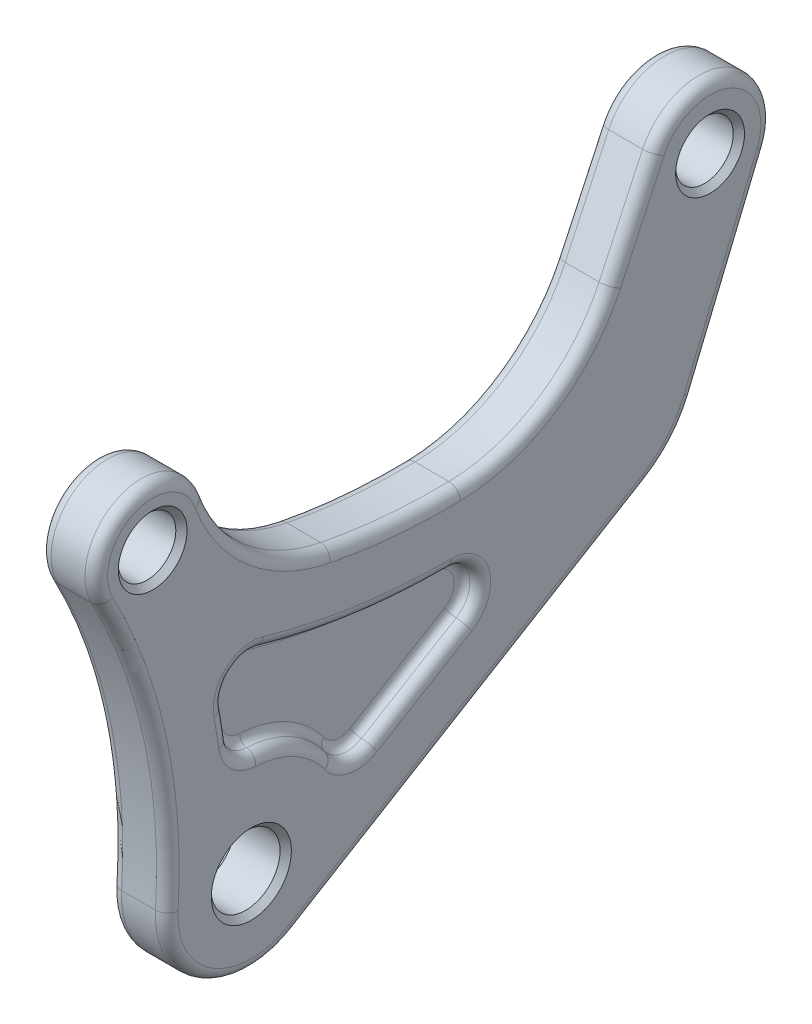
ISO-10303-21;
HEADER;
FILE_DESCRIPTION(('STEP AP214'),'2;1');
FILE_NAME('part.step','',(''),(''),'','','');
FILE_SCHEMA(('AUTOMOTIVE_DESIGN { 1 0 10303 214 1 1 1 1 }'));
ENDSEC;
DATA;
#1=APPLICATION_CONTEXT('core data for automotive mechanical design processes');
#2=APPLICATION_PROTOCOL_DEFINITION('international standard','automotive_design',2000,#1);
#3=PRODUCT_CONTEXT('',#1,'mechanical');
#4=PRODUCT('Part','Part','',(#3));
#5=PRODUCT_RELATED_PRODUCT_CATEGORY('part','',(#4));
#6=PRODUCT_DEFINITION_FORMATION('','',#4);
#7=PRODUCT_DEFINITION_CONTEXT('part definition',#1,'design');
#8=PRODUCT_DEFINITION('design','',#6,#7);
#9=PRODUCT_DEFINITION_SHAPE('','',#8);
#10=(LENGTH_UNIT() NAMED_UNIT(*) SI_UNIT(.MILLI.,.METRE.));
#11=(NAMED_UNIT(*) PLANE_ANGLE_UNIT() SI_UNIT($,.RADIAN.));
#12=(NAMED_UNIT(*) SI_UNIT($,.STERADIAN.) SOLID_ANGLE_UNIT());
#13=UNCERTAINTY_MEASURE_WITH_UNIT(LENGTH_MEASURE(1.E-05),#10,'distance_accuracy_value','');
#14=(GEOMETRIC_REPRESENTATION_CONTEXT(3) GLOBAL_UNCERTAINTY_ASSIGNED_CONTEXT((#13)) GLOBAL_UNIT_ASSIGNED_CONTEXT((#10,
#11,#12)) REPRESENTATION_CONTEXT('',''));
#15=CARTESIAN_POINT('',(0.,0.,0.));
#16=DIRECTION('',(0.,0.,1.));
#17=DIRECTION('',(1.,0.,0.));
#18=AXIS2_PLACEMENT_3D('',#15,#16,#17);
#19=CARTESIAN_POINT('',(7.,0.,0.));
#20=DIRECTION('',(1.,0.,0.));
#21=DIRECTION('',(0.,0.,-1.));
#22=AXIS2_PLACEMENT_3D('',#19,#20,#21);
#23=PLANE('',#22);
#24=CARTESIAN_POINT('',(7.00000000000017,13.59229228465,-18.67778333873));
#25=DIRECTION('',(-1.,0.,0.));
#26=DIRECTION('',(0.,-0.856470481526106,-0.516196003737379));
#27=AXIS2_PLACEMENT_3D('',#24,#25,#26);
#28=CIRCLE('',#27,3.50000070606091);
#29=CARTESIAN_POINT('',(7.00000000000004,11.5328538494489,-15.8478158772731));
#30=VERTEX_POINT('',#29);
#31=CARTESIAN_POINT('',(7.00000000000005,10.5946453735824,-20.4844694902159));
#32=VERTEX_POINT('',#31);
#33=EDGE_CURVE('E389',#30,#32,#28,.F.);
#34=ORIENTED_EDGE('',*,*,#33,.T.);
#35=DIRECTION('',(0.,-0.516196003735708,0.856470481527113));
#36=VECTOR('',#35,1.);
#37=CARTESIAN_POINT('',(7.,20.876555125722,-37.5441752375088));
#38=LINE('',#37,#36);
#39=CARTESIAN_POINT('',(7.,20.7031691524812,-37.2564938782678));
#40=VERTEX_POINT('',#39);
#41=EDGE_CURVE('E312',#32,#40,#38,.F.);
#42=ORIENTED_EDGE('',*,*,#41,.T.);
#43=CARTESIAN_POINT('',(7.,23.70081583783,-35.44980786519));
#44=DIRECTION('',(-1.,0.,0.));
#45=DIRECTION('',(0.,0.999993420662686,0.00362748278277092));
#46=AXIS2_PLACEMENT_3D('',#43,#44,#45);
#47=CIRCLE('',#46,3.50000000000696);
#48=CARTESIAN_POINT('',(7.00000000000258,27.2007893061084,-35.4371116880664));
#49=VERTEX_POINT('',#48);
#50=EDGE_CURVE('E305',#40,#49,#47,.F.);
#51=ORIENTED_EDGE('',*,*,#50,.T.);
#52=CARTESIAN_POINT('',(7.00000000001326,147.7,-35.));
#53=DIRECTION('',(1.,0.,0.));
#54=DIRECTION('',(0.,-0.95985194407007,0.280507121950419));
#55=AXIS2_PLACEMENT_3D('',#52,#53,#54);
#56=CIRCLE('',#55,120.500006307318);
#57=CARTESIAN_POINT('',(7.0000000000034,32.0378382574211,-1.19889107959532));
#58=VERTEX_POINT('',#57);
#59=EDGE_CURVE('E310',#49,#58,#56,.F.);
#60=ORIENTED_EDGE('',*,*,#59,.T.);
#61=CARTESIAN_POINT('',(7.00000000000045,28.67835893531,-0.2171168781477));
#62=DIRECTION('',(-1.,0.,0.));
#63=DIRECTION('',(0.,-0.18426593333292,0.982876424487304));
#64=AXIS2_PLACEMENT_3D('',#61,#62,#63);
#65=CIRCLE('',#64,3.49999884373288);
#66=CARTESIAN_POINT('',(7.00000000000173,28.0334287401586,3.22294755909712));
#67=VERTEX_POINT('',#66);
#68=EDGE_CURVE('E337',#58,#67,#65,.F.);
#69=ORIENTED_EDGE('',*,*,#68,.T.);
#70=CARTESIAN_POINT('',(7.0000000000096,7.119244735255,114.7794247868));
#71=DIRECTION('',(1.,0.,0.));
#72=DIRECTION('',(0.,0.136352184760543,-0.990660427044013));
#73=AXIS2_PLACEMENT_3D('',#70,#71,#72);
#74=CIRCLE('',#73,113.500005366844);
#75=CARTESIAN_POINT('',(7.0000000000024,22.595217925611,2.33946471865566));
#76=VERTEX_POINT('',#75);
#77=EDGE_CURVE('E356',#67,#76,#74,.F.);
#78=ORIENTED_EDGE('',*,*,#77,.T.);
#79=CARTESIAN_POINT('',(7.,23.07245035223,-1.127845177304));
#80=DIRECTION('',(-1.,0.,0.));
#81=DIRECTION('',(0.,-0.998807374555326,0.0488244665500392));
#82=AXIS2_PLACEMENT_3D('',#79,#80,#81);
#83=CIRCLE('',#82,3.49999999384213);
#84=CARTESIAN_POINT('',(7.,19.5766246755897,-0.956959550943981));
#85=VERTEX_POINT('',#84);
#86=EDGE_CURVE('E367',#76,#85,#83,.F.);
#87=ORIENTED_EDGE('',*,*,#86,.T.);
#88=CARTESIAN_POINT('',(7.00000000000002,0.,0.));
#89=DIRECTION('',(1.,0.,0.));
#90=DIRECTION('',(0.,0.588410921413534,-0.808562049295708));
#91=AXIS2_PLACEMENT_3D('',#88,#89,#90);
#92=CIRCLE('',#91,19.6000002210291);
#93=EDGE_CURVE('E378',#85,#30,#92,.F.);
#94=ORIENTED_EDGE('',*,*,#93,.T.);
#95=EDGE_LOOP('',(#34,#42,#51,#60,#69,#78,#87,#94));
#96=FACE_BOUND('',#95,.T.);
#97=ADVANCED_FACE('F14',(#96),#23,.T.);
#98=CARTESIAN_POINT('',(8.5,23.70081583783,-35.44980786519));
#99=DIRECTION('',(1.,0.,0.));
#100=DIRECTION('',(0.,0.997494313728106,0.0707466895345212));
#101=AXIS2_PLACEMENT_3D('',#98,#99,#100);
#102=TOROIDAL_SURFACE('',#101,3.5,1.5);
#103=CARTESIAN_POINT('',(8.5,27.2007928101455,-35.4371116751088));
#104=DIRECTION('',(0.,0.00362748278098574,-0.999993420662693));
#105=DIRECTION('',(0.,-0.999993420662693,-0.00362748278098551));
#106=AXIS2_PLACEMENT_3D('',#103,#104,#105);
#107=CIRCLE('',#106,1.5);
#108=CARTESIAN_POINT('',(8.28571428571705,28.6853980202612,-35.43172625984));
#109=VERTEX_POINT('',#108);
#110=EDGE_CURVE('E325',#109,#49,#107,.F.);
#111=ORIENTED_EDGE('',*,*,#110,.T.);
#112=ORIENTED_EDGE('',*,*,#50,.F.);
#113=CARTESIAN_POINT('',(8.5,20.7031691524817,-37.256493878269));
#114=DIRECTION('',(0.,-0.516196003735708,0.856470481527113));
#115=DIRECTION('',(0.,-0.856470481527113,-0.516196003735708));
#116=AXIS2_PLACEMENT_3D('',#113,#114,#115);
#117=CIRCLE('',#116,1.5);
#118=CARTESIAN_POINT('',(8.28571428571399,19.431640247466,-38.0228461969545));
#119=VERTEX_POINT('',#118);
#120=EDGE_CURVE('E318',#40,#119,#117,.T.);
#121=ORIENTED_EDGE('',*,*,#120,.T.);
#122=CARTESIAN_POINT('',(8.28571428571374,23.70081583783,-35.44980786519));
#123=DIRECTION('',(1.,0.,0.));
#124=DIRECTION('',(0.,-0.883245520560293,-0.468910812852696));
#125=AXIS2_PLACEMENT_3D('',#122,#123,#124);
#126=CIRCLE('',#125,4.98461497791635);
#127=EDGE_CURVE('E332',#109,#119,#126,.F.);
#128=ORIENTED_EDGE('',*,*,#127,.F.);
#129=EDGE_LOOP('',(#111,#112,#121,#128));
#130=FACE_BOUND('',#129,.T.);
#131=ADVANCED_FACE('F331',(#130),#102,.F.);
#132=CARTESIAN_POINT('',(8.5,20.7031691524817,-37.256493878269));
#133=DIRECTION('',(0.,-0.516196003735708,0.856470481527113));
#134=DIRECTION('',(0.,-0.856470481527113,-0.516196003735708));
#135=AXIS2_PLACEMENT_3D('',#132,#133,#134);
#136=CYLINDRICAL_SURFACE('',#135,1.5);
#137=CARTESIAN_POINT('',(8.5,10.5946455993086,-20.4844693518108));
#138=DIRECTION('',(0.,0.516196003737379,-0.856470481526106));
#139=DIRECTION('',(0.,-0.856470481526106,-0.516196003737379));
#140=AXIS2_PLACEMENT_3D('',#137,#138,#139);
#141=CIRCLE('',#140,1.5);
#142=CARTESIAN_POINT('',(8.28571428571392,9.32311669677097,-21.2508216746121));
#143=VERTEX_POINT('',#142);
#144=EDGE_CURVE('E386',#32,#143,#141,.F.);
#145=ORIENTED_EDGE('',*,*,#144,.T.);
#146=DIRECTION('',(0.,0.516196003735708,-0.856470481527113));
#147=VECTOR('',#146,1.);
#148=CARTESIAN_POINT('',(8.28571428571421,9.19890897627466,-21.044736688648));
#149=LINE('',#148,#147);
#150=EDGE_CURVE('E392',#119,#143,#149,.F.);
#151=ORIENTED_EDGE('',*,*,#150,.F.);
#152=ORIENTED_EDGE('',*,*,#120,.F.);
#153=ORIENTED_EDGE('',*,*,#41,.F.);
#154=EDGE_LOOP('',(#145,#151,#152,#153));
#155=FACE_BOUND('',#154,.T.);
#156=ADVANCED_FACE('F424',(#155),#136,.F.);
#157=CARTESIAN_POINT('',(8.5,13.59229228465,-18.67778333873));
#158=DIRECTION('',(1.,0.,0.));
#159=DIRECTION('',(0.,-0.819887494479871,-0.57252466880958));
#160=AXIS2_PLACEMENT_3D('',#157,#158,#159);
#161=TOROIDAL_SURFACE('',#160,3.5,1.5);
#162=CARTESIAN_POINT('',(8.5,11.5328540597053,-15.8478161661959));
#163=DIRECTION('',(0.,0.808562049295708,0.588410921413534));
#164=DIRECTION('',(0.,0.588410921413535,-0.808562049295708));
#165=AXIS2_PLACEMENT_3D('',#162,#163,#164);
#166=CIRCLE('',#165,1.5);
#167=CARTESIAN_POINT('',(8.28571428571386,10.6592903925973,-14.6474128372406));
#168=VERTEX_POINT('',#167);
#169=EDGE_CURVE('E375',#30,#168,#166,.T.);
#170=ORIENTED_EDGE('',*,*,#169,.T.);
#171=CARTESIAN_POINT('',(8.28571428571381,13.59229228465,-18.67778333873));
#172=DIRECTION('',(1.,0.,0.));
#173=DIRECTION('',(0.,-0.543621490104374,0.83933049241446));
#174=AXIS2_PLACEMENT_3D('',#171,#172,#173);
#175=CIRCLE('',#174,4.98461497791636);
#176=EDGE_CURVE('E381',#143,#168,#175,.F.);
#177=ORIENTED_EDGE('',*,*,#176,.F.);
#178=ORIENTED_EDGE('',*,*,#144,.F.);
#179=ORIENTED_EDGE('',*,*,#33,.F.);
#180=EDGE_LOOP('',(#170,#177,#178,#179));
#181=FACE_BOUND('',#180,.T.);
#182=ADVANCED_FACE('F436',(#181),#161,.F.);
#183=CARTESIAN_POINT('',(8.5,0.,0.));
#184=DIRECTION('',(1.,0.,0.));
#185=DIRECTION('',(0.,0.577798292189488,-0.816179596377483));
#186=AXIS2_PLACEMENT_3D('',#183,#184,#185);
#187=TOROIDAL_SURFACE('',#186,19.6,1.5);
#188=ORIENTED_EDGE('',*,*,#169,.F.);
#189=ORIENTED_EDGE('',*,*,#93,.F.);
#190=CARTESIAN_POINT('',(8.5,19.5766245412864,-0.956959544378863));
#191=DIRECTION('',(0.,-0.0488244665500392,-0.998807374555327));
#192=DIRECTION('',(0.,-0.998807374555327,0.0488244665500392));
#193=AXIS2_PLACEMENT_3D('',#190,#191,#192);
#194=CIRCLE('',#193,1.5);
#195=CARTESIAN_POINT('',(8.28571428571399,18.0937801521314,-0.884474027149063));
#196=VERTEX_POINT('',#195);
#197=EDGE_CURVE('E364',#85,#196,#194,.F.);
#198=ORIENTED_EDGE('',*,*,#197,.T.);
#199=CARTESIAN_POINT('',(8.28571428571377,0.,0.));
#200=DIRECTION('',(1.,0.,0.));
#201=DIRECTION('',(0.,0.999331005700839,-0.0365724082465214));
#202=AXIS2_PLACEMENT_3D('',#199,#200,#201);
#203=CIRCLE('',#202,18.1153850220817);
#204=EDGE_CURVE('E370',#168,#196,#203,.T.);
#205=ORIENTED_EDGE('',*,*,#204,.F.);
#206=EDGE_LOOP('',(#188,#189,#198,#205));
#207=FACE_BOUND('',#206,.T.);
#208=ADVANCED_FACE('F440',(#207),#187,.F.);
#209=CARTESIAN_POINT('',(8.5,23.07245035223,-1.127845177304));
#210=DIRECTION('',(1.,0.,0.));
#211=DIRECTION('',(0.,-0.999831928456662,-0.0183334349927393));
#212=AXIS2_PLACEMENT_3D('',#209,#210,#211);
#213=TOROIDAL_SURFACE('',#212,3.5,1.5);
#214=ORIENTED_EDGE('',*,*,#197,.F.);
#215=ORIENTED_EDGE('',*,*,#86,.F.);
#216=CARTESIAN_POINT('',(8.5,22.5952177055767,2.33946631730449));
#217=DIRECTION('',(0.,0.990660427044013,0.136352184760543));
#218=DIRECTION('',(0.,0.136352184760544,-0.990660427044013));
#219=AXIS2_PLACEMENT_3D('',#216,#217,#218);
#220=CIRCLE('',#219,1.5);
#221=CARTESIAN_POINT('',(8.28571428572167,22.3927872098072,3.81021562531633));
#222=VERTEX_POINT('',#221);
#223=EDGE_CURVE('E353',#76,#222,#220,.T.);
#224=ORIENTED_EDGE('',*,*,#223,.T.);
#225=CARTESIAN_POINT('',(8.28571428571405,23.07245035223,-1.127845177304));
#226=DIRECTION('',(1.,0.,0.));
#227=DIRECTION('',(0.,-0.0823386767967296,0.996604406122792));
#228=AXIS2_PLACEMENT_3D('',#225,#226,#227);
#229=CIRCLE('',#228,4.98461497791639);
#230=EDGE_CURVE('E359',#196,#222,#229,.F.);
#231=ORIENTED_EDGE('',*,*,#230,.F.);
#232=EDGE_LOOP('',(#214,#215,#224,#231));
#233=FACE_BOUND('',#232,.T.);
#234=ADVANCED_FACE('F445',(#233),#213,.F.);
#235=CARTESIAN_POINT('',(8.5,7.119244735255,114.7794247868));
#236=DIRECTION('',(1.,0.,0.));
#237=DIRECTION('',(0.,0.134260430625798,-0.990946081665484));
#238=AXIS2_PLACEMENT_3D('',#235,#236,#237);
#239=TOROIDAL_SURFACE('',#238,113.5,1.5);
#240=ORIENTED_EDGE('',*,*,#223,.F.);
#241=ORIENTED_EDGE('',*,*,#77,.F.);
#242=CARTESIAN_POINT('',(8.5,28.0334281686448,3.22295060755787));
#243=DIRECTION('',(0.,-0.982876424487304,-0.184265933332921));
#244=DIRECTION('',(0.,-0.18426593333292,0.982876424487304));
#245=AXIS2_PLACEMENT_3D('',#242,#243,#244);
#246=CIRCLE('',#245,1.5);
#247=CARTESIAN_POINT('',(8.28571428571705,27.7598642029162,4.68214366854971));
#248=VERTEX_POINT('',#247);
#249=EDGE_CURVE('E334',#67,#248,#246,.F.);
#250=ORIENTED_EDGE('',*,*,#249,.T.);
#251=CARTESIAN_POINT('',(8.28571428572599,7.119244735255,114.7794247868));
#252=DIRECTION('',(1.,0.,0.));
#253=DIRECTION('',(0.,0.186252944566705,-0.982501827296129));
#254=AXIS2_PLACEMENT_3D('',#251,#252,#253);
#255=CIRCLE('',#254,112.01538502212);
#256=EDGE_CURVE('E347',#222,#248,#255,.T.);
#257=ORIENTED_EDGE('',*,*,#256,.F.);
#258=EDGE_LOOP('',(#240,#241,#250,#257));
#259=FACE_BOUND('',#258,.T.);
#260=ADVANCED_FACE('F540',(#259),#239,.F.);
#261=CARTESIAN_POINT('',(8.5,28.67835893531,-0.2171168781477));
#262=DIRECTION('',(1.,0.,0.));
#263=DIRECTION('',(0.,-0.249828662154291,0.968290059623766));
#264=AXIS2_PLACEMENT_3D('',#261,#262,#263);
#265=TOROIDAL_SURFACE('',#264,3.5,1.5);
#266=ORIENTED_EDGE('',*,*,#249,.F.);
#267=ORIENTED_EDGE('',*,*,#68,.F.);
#268=CARTESIAN_POINT('',(8.5,32.0378407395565,-1.19889180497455));
#269=DIRECTION('',(0.,-0.280507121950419,-0.95985194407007));
#270=DIRECTION('',(0.,-0.95985194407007,0.280507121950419));
#271=AXIS2_PLACEMENT_3D('',#268,#269,#270);
#272=CIRCLE('',#271,1.5);
#273=CARTESIAN_POINT('',(8.28571428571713,33.4628513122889,-1.61533687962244));
#274=VERTEX_POINT('',#273);
#275=EDGE_CURVE('E328',#58,#274,#272,.T.);
#276=ORIENTED_EDGE('',*,*,#275,.T.);
#277=CARTESIAN_POINT('',(8.28571428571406,28.67835893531,-0.2171168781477));
#278=DIRECTION('',(1.,0.,0.));
#279=DIRECTION('',(0.,0.943197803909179,-0.332231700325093));
#280=AXIS2_PLACEMENT_3D('',#277,#278,#279);
#281=CIRCLE('',#280,4.98461497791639);
#282=EDGE_CURVE('E568',#248,#274,#281,.F.);
#283=ORIENTED_EDGE('',*,*,#282,.F.);
#284=EDGE_LOOP('',(#266,#267,#276,#283));
#285=FACE_BOUND('',#284,.T.);
#286=ADVANCED_FACE('F521',(#285),#265,.F.);
#287=CARTESIAN_POINT('',(8.5,147.7,-35.));
#288=DIRECTION('',(1.,0.,0.));
#289=DIRECTION('',(0.,-0.959292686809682,0.282413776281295));
#290=AXIS2_PLACEMENT_3D('',#287,#288,#289);
#291=TOROIDAL_SURFACE('',#290,120.5,1.5);
#292=ORIENTED_EDGE('',*,*,#275,.F.);
#293=ORIENTED_EDGE('',*,*,#59,.F.);
#294=ORIENTED_EDGE('',*,*,#110,.F.);
#295=CARTESIAN_POINT('',(8.28571428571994,147.7,-35.));
#296=DIRECTION('',(1.,0.,0.));
#297=DIRECTION('',(0.,-0.999984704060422,-0.00553097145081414));
#298=AXIS2_PLACEMENT_3D('',#295,#296,#297);
#299=CIRCLE('',#298,119.015385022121);
#300=EDGE_CURVE('E581',#274,#109,#299,.T.);
#301=ORIENTED_EDGE('',*,*,#300,.F.);
#302=EDGE_LOOP('',(#292,#293,#294,#301));
#303=FACE_BOUND('',#302,.T.);
#304=ADVANCED_FACE('F323',(#303),#291,.F.);
#305=CARTESIAN_POINT('',(8.,23.70081583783,-35.44980786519));
#306=DIRECTION('',(1.,0.,0.));
#307=DIRECTION('',(0.,-0.883245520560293,-0.468910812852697));
#308=AXIS2_PLACEMENT_3D('',#305,#306,#307);
#309=TOROIDAL_SURFACE('',#308,6.964101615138,2.);
#310=CARTESIAN_POINT('',(8.,30.6648716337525,-35.4245457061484));
#311=DIRECTION('',(0.,0.00362748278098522,-0.999993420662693));
#312=DIRECTION('',(0.,-0.999993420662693,-0.00362748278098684));
#313=AXIS2_PLACEMENT_3D('',#310,#311,#312);
#314=CIRCLE('',#313,2.);
#315=CARTESIAN_POINT('',(9.99999999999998,30.6648710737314,-35.4245457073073));
#316=VERTEX_POINT('',#315);
#317=EDGE_CURVE('E575',#109,#316,#314,.F.);
#318=ORIENTED_EDGE('',*,*,#317,.F.);
#319=ORIENTED_EDGE('',*,*,#127,.T.);
#320=CARTESIAN_POINT('',(8.,17.7362683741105,-39.0446492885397));
#321=DIRECTION('',(0.,0.516196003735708,-0.856470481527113));
#322=DIRECTION('',(0.142857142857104,0.847685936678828,0.510901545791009));
#323=AXIS2_PLACEMENT_3D('',#320,#321,#322);
#324=CIRCLE('',#323,2.);
#325=CARTESIAN_POINT('',(9.99999999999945,17.7362690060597,-39.0446489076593));
#326=VERTEX_POINT('',#325);
#327=EDGE_CURVE('E394',#326,#119,#324,.F.);
#328=ORIENTED_EDGE('',*,*,#327,.F.);
#329=CARTESIAN_POINT('',(10.,23.70081583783,-35.44980786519));
#330=DIRECTION('',(1.,0.,0.));
#331=DIRECTION('',(0.,-0.856470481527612,-0.51619600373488));
#332=AXIS2_PLACEMENT_3D('',#329,#330,#331);
#333=CIRCLE('',#332,6.96410161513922);
#334=EDGE_CURVE('E583',#316,#326,#333,.F.);
#335=ORIENTED_EDGE('',*,*,#334,.F.);
#336=EDGE_LOOP('',(#318,#319,#328,#335));
#337=FACE_BOUND('',#336,.T.);
#338=ADVANCED_FACE('F554',(#337),#309,.T.);
#339=CARTESIAN_POINT('',(8.,7.62774482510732,-22.2726247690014));
#340=DIRECTION('',(0.,0.516196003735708,-0.856470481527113));
#341=DIRECTION('',(0.,0.856470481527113,0.516196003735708));
#342=AXIS2_PLACEMENT_3D('',#339,#340,#341);
#343=CYLINDRICAL_SURFACE('',#342,2.);
#344=ORIENTED_EDGE('',*,*,#327,.T.);
#345=ORIENTED_EDGE('',*,*,#150,.T.);
#346=CARTESIAN_POINT('',(8.,7.62774482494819,-22.2726247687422));
#347=DIRECTION('',(0.,0.516196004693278,-0.856470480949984));
#348=DIRECTION('',(0.,-0.856470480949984,-0.516196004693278));
#349=AXIS2_PLACEMENT_3D('',#346,#347,#348);
#350=CIRCLE('',#349,2.);
#351=CARTESIAN_POINT('',(9.99999999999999,7.62774597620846,-22.272624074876));
#352=VERTEX_POINT('',#351);
#353=EDGE_CURVE('E383',#352,#143,#350,.F.);
#354=ORIENTED_EDGE('',*,*,#353,.F.);
#355=DIRECTION('',(0.,-0.516195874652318,0.856470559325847));
#356=VECTOR('',#355,1.);
#357=CARTESIAN_POINT('',(10.,17.73626837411,-39.04464928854));
#358=LINE('',#357,#356);
#359=EDGE_CURVE('E1620',#326,#352,#358,.T.);
#360=ORIENTED_EDGE('',*,*,#359,.F.);
#361=EDGE_LOOP('',(#344,#345,#354,#360));
#362=FACE_BOUND('',#361,.T.);
#363=ADVANCED_FACE('F558',(#362),#343,.T.);
#364=CARTESIAN_POINT('',(8.,13.59229228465,-18.67778333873));
#365=DIRECTION('',(1.,0.,0.));
#366=DIRECTION('',(0.,-0.543621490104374,0.83933049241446));
#367=AXIS2_PLACEMENT_3D('',#364,#365,#366);
#368=TOROIDAL_SURFACE('',#367,6.964101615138,2.);
#369=ORIENTED_EDGE('',*,*,#353,.T.);
#370=ORIENTED_EDGE('',*,*,#176,.T.);
#371=CARTESIAN_POINT('',(8.,9.49453883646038,-13.0468750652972));
#372=DIRECTION('',(0.,0.808562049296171,0.588410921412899));
#373=DIRECTION('',(0.,0.588410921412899,-0.808562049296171));
#374=AXIS2_PLACEMENT_3D('',#371,#372,#373);
#375=CIRCLE('',#374,2.);
#376=CARTESIAN_POINT('',(9.99999999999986,9.49453895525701,-13.0468752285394));
#377=VERTEX_POINT('',#376);
#378=EDGE_CURVE('E372',#377,#168,#375,.T.);
#379=ORIENTED_EDGE('',*,*,#378,.F.);
#380=CARTESIAN_POINT('',(9.99999999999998,13.59229228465,-18.67778333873));
#381=DIRECTION('',(1.,0.,0.));
#382=DIRECTION('',(0.,-0.58841092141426,0.80856204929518));
#383=AXIS2_PLACEMENT_3D('',#380,#381,#382);
#384=CIRCLE('',#383,6.96410187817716);
#385=EDGE_CURVE('E685',#352,#377,#384,.F.);
#386=ORIENTED_EDGE('',*,*,#385,.F.);
#387=EDGE_LOOP('',(#369,#370,#379,#386));
#388=FACE_BOUND('',#387,.T.);
#389=ADVANCED_FACE('F603',(#388),#368,.T.);
#390=CARTESIAN_POINT('',(8.,0.,0.));
#391=DIRECTION('',(1.,0.,0.));
#392=DIRECTION('',(0.,0.999331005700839,-0.0365724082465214));
#393=AXIS2_PLACEMENT_3D('',#390,#391,#392);
#394=TOROIDAL_SURFACE('',#393,16.13589838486,2.);
#395=ORIENTED_EDGE('',*,*,#378,.T.);
#396=ORIENTED_EDGE('',*,*,#204,.T.);
#397=CARTESIAN_POINT('',(8.,16.1166543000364,-0.787826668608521));
#398=DIRECTION('',(0.,-0.0488244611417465,-0.998807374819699));
#399=DIRECTION('',(0.,-0.998807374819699,0.0488244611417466));
#400=AXIS2_PLACEMENT_3D('',#397,#398,#399);
#401=CIRCLE('',#400,2.);
#402=CARTESIAN_POINT('',(9.99999999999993,16.1166554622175,-0.78782672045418));
#403=VERTEX_POINT('',#402);
#404=EDGE_CURVE('E361',#403,#196,#401,.F.);
#405=ORIENTED_EDGE('',*,*,#404,.F.);
#406=CARTESIAN_POINT('',(9.99999999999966,0.,0.));
#407=DIRECTION('',(-1.,0.,0.));
#408=DIRECTION('',(0.,0.998807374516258,-0.0488244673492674));
#409=AXIS2_PLACEMENT_3D('',#406,#407,#408);
#410=CIRCLE('',#409,16.13589954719);
#411=EDGE_CURVE('E674',#377,#403,#410,.F.);
#412=ORIENTED_EDGE('',*,*,#411,.F.);
#413=EDGE_LOOP('',(#395,#396,#405,#412));
#414=FACE_BOUND('',#413,.T.);
#415=ADVANCED_FACE('F612',(#414),#394,.T.);
#416=CARTESIAN_POINT('',(8.,23.07245035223,-1.127845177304));
#417=DIRECTION('',(1.,0.,0.));
#418=DIRECTION('',(0.,-0.0823386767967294,0.996604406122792));
#419=AXIS2_PLACEMENT_3D('',#416,#417,#418);
#420=TOROIDAL_SURFACE('',#419,6.964101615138,2.);
#421=ORIENTED_EDGE('',*,*,#404,.T.);
#422=ORIENTED_EDGE('',*,*,#230,.T.);
#423=CARTESIAN_POINT('',(8.,22.1228798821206,5.77121470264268));
#424=DIRECTION('',(0.,0.990660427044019,0.136352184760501));
#425=DIRECTION('',(0.,0.136352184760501,-0.990660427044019));
#426=AXIS2_PLACEMENT_3D('',#423,#424,#425);
#427=CIRCLE('',#426,2.);
#428=CARTESIAN_POINT('',(9.99999999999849,22.1228800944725,5.77121315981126));
#429=VERTEX_POINT('',#428);
#430=EDGE_CURVE('E350',#429,#222,#427,.T.);
#431=ORIENTED_EDGE('',*,*,#430,.F.);
#432=CARTESIAN_POINT('',(10.,23.07245035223,-1.127845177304));
#433=DIRECTION('',(1.,0.,0.));
#434=DIRECTION('',(0.,-0.136352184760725,0.990660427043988));
#435=AXIS2_PLACEMENT_3D('',#432,#433,#434);
#436=CIRCLE('',#435,6.96410161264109);
#437=EDGE_CURVE('E659',#403,#429,#436,.F.);
#438=ORIENTED_EDGE('',*,*,#437,.F.);
#439=EDGE_LOOP('',(#421,#422,#431,#438));
#440=FACE_BOUND('',#439,.T.);
#441=ADVANCED_FACE('F617',(#440),#420,.T.);
#442=CARTESIAN_POINT('',(8.,7.119244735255,114.7794247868));
#443=DIRECTION('',(1.,0.,0.));
#444=DIRECTION('',(0.,0.186252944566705,-0.982501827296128));
#445=AXIS2_PLACEMENT_3D('',#442,#443,#444);
#446=TOROIDAL_SURFACE('',#445,110.0358983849,2.);
#447=ORIENTED_EDGE('',*,*,#430,.T.);
#448=ORIENTED_EDGE('',*,*,#256,.T.);
#449=CARTESIAN_POINT('',(8.,27.3951122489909,6.62773441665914));
#450=DIRECTION('',(0.,-0.982876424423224,-0.184265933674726));
#451=DIRECTION('',(0.,-0.184265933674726,0.982876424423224));
#452=AXIS2_PLACEMENT_3D('',#449,#450,#451);
#453=CIRCLE('',#452,2.);
#454=CARTESIAN_POINT('',(9.99999999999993,27.395113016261,6.62773032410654));
#455=VERTEX_POINT('',#454);
#456=EDGE_CURVE('E349',#455,#248,#453,.F.);
#457=ORIENTED_EDGE('',*,*,#456,.F.);
#458=CARTESIAN_POINT('',(9.99999999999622,7.119244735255,114.7794247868));
#459=DIRECTION('',(-1.,0.,0.));
#460=DIRECTION('',(0.,0.184265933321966,-0.982876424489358));
#461=AXIS2_PLACEMENT_3D('',#458,#459,#460);
#462=CIRCLE('',#461,110.035902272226);
#463=EDGE_CURVE('E1612',#429,#455,#462,.F.);
#464=ORIENTED_EDGE('',*,*,#463,.F.);
#465=EDGE_LOOP('',(#447,#448,#457,#464));
#466=FACE_BOUND('',#465,.T.);
#467=ADVANCED_FACE('F630',(#466),#446,.T.);
#468=CARTESIAN_POINT('',(8.,28.67835893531,-0.2171168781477));
#469=DIRECTION('',(1.,0.,0.));
#470=DIRECTION('',(0.,0.943197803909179,-0.332231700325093));
#471=AXIS2_PLACEMENT_3D('',#468,#469,#470);
#472=TOROIDAL_SURFACE('',#471,6.964101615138,2.);
#473=ORIENTED_EDGE('',*,*,#456,.T.);
#474=ORIENTED_EDGE('',*,*,#282,.T.);
#475=CARTESIAN_POINT('',(8.,35.3628654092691,-2.17059697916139));
#476=DIRECTION('',(0.,-0.280507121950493,-0.959851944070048));
#477=DIRECTION('',(0.,-0.959851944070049,0.280507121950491));
#478=AXIS2_PLACEMENT_3D('',#475,#476,#477);
#479=CIRCLE('',#478,2.);
#480=CARTESIAN_POINT('',(9.99999999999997,35.3628647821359,-2.17059679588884));
#481=VERTEX_POINT('',#480);
#482=EDGE_CURVE('E584',#481,#274,#479,.T.);
#483=ORIENTED_EDGE('',*,*,#482,.F.);
#484=CARTESIAN_POINT('',(9.99999999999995,28.67835893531,-0.2171168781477));
#485=DIRECTION('',(1.,0.,0.));
#486=DIRECTION('',(0.,0.959851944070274,-0.28050712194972));
#487=AXIS2_PLACEMENT_3D('',#484,#485,#486);
#488=CIRCLE('',#487,6.9641011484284);
#489=EDGE_CURVE('E1608',#455,#481,#488,.F.);
#490=ORIENTED_EDGE('',*,*,#489,.F.);
#491=EDGE_LOOP('',(#473,#474,#483,#490));
#492=FACE_BOUND('',#491,.T.);
#493=ADVANCED_FACE('F634',(#492),#472,.T.);
#494=CARTESIAN_POINT('',(8.,147.7,-35.));
#495=DIRECTION('',(1.,0.,0.));
#496=DIRECTION('',(0.,-0.999984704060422,-0.0055309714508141));
#497=AXIS2_PLACEMENT_3D('',#494,#495,#496);
#498=TOROIDAL_SURFACE('',#497,117.0358983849,2.);
#499=ORIENTED_EDGE('',*,*,#482,.T.);
#500=ORIENTED_EDGE('',*,*,#300,.T.);
#501=ORIENTED_EDGE('',*,*,#317,.T.);
#502=CARTESIAN_POINT('',(9.99999999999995,147.7,-35.));
#503=DIRECTION('',(-1.,0.,0.));
#504=DIRECTION('',(0.,-0.999993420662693,-0.00362748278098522));
#505=AXIS2_PLACEMENT_3D('',#502,#503,#504);
#506=CIRCLE('',#505,117.035898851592);
#507=EDGE_CURVE('E1604',#481,#316,#506,.F.);
#508=ORIENTED_EDGE('',*,*,#507,.F.);
#509=EDGE_LOOP('',(#499,#500,#501,#508));
#510=FACE_BOUND('',#509,.T.);
#511=ADVANCED_FACE('F1661',(#510),#498,.T.);
#512=CARTESIAN_POINT('',(10.,0.,0.));
#513=DIRECTION('',(1.,0.,0.));
#514=DIRECTION('',(0.,0.,-1.));
#515=AXIS2_PLACEMENT_3D('',#512,#513,#514);
#516=PLANE('',#515);
#517=ORIENTED_EDGE('',*,*,#489,.T.);
#518=ORIENTED_EDGE('',*,*,#507,.T.);
#519=ORIENTED_EDGE('',*,*,#334,.T.);
#520=ORIENTED_EDGE('',*,*,#359,.T.);
#521=ORIENTED_EDGE('',*,*,#385,.T.);
#522=ORIENTED_EDGE('',*,*,#411,.T.);
#523=ORIENTED_EDGE('',*,*,#437,.T.);
#524=ORIENTED_EDGE('',*,*,#463,.T.);
#525=EDGE_LOOP('',(#517,#518,#519,#520,#521,#522,#523,#524));
#526=FACE_BOUND('',#525,.T.);
#527=CARTESIAN_POINT('',(9.99999999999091,69.9,-81.3));
#528=DIRECTION('',(1.,0.,0.));
#529=DIRECTION('',(0.,0.,-1.));
#530=AXIS2_PLACEMENT_3D('',#527,#528,#529);
#531=CIRCLE('',#530,6.10000000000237);
#532=CARTESIAN_POINT('',(9.99999999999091,69.9,-87.4000000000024));
#533=VERTEX_POINT('',#532);
#534=EDGE_CURVE('E1362',#533,#533,#531,.F.);
#535=ORIENTED_EDGE('',*,*,#534,.T.);
#536=EDGE_LOOP('',(#535));
#537=FACE_BOUND('',#536,.T.);
#538=CARTESIAN_POINT('',(9.99999999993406,0.,0.));
#539=DIRECTION('',(1.,0.,0.));
#540=DIRECTION('',(0.,0.,-1.));
#541=AXIS2_PLACEMENT_3D('',#538,#539,#540);
#542=CIRCLE('',#541,7.0999999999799);
#543=CARTESIAN_POINT('',(9.99999999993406,0.,-7.0999999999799));
#544=VERTEX_POINT('',#543);
#545=EDGE_CURVE('E1364',#544,#544,#542,.F.);
#546=ORIENTED_EDGE('',*,*,#545,.T.);
#547=EDGE_LOOP('',(#546));
#548=FACE_BOUND('',#547,.T.);
#549=CARTESIAN_POINT('',(9.99999999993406,58.417,17.473));
#550=DIRECTION('',(1.,0.,0.));
#551=DIRECTION('',(0.,0.,-1.));
#552=AXIS2_PLACEMENT_3D('',#549,#550,#551);
#553=CIRCLE('',#552,6.10000000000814);
#554=CARTESIAN_POINT('',(9.99999999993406,58.417,11.3729999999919));
#555=VERTEX_POINT('',#554);
#556=EDGE_CURVE('E19',#555,#555,#553,.F.);
#557=ORIENTED_EDGE('',*,*,#556,.T.);
#558=EDGE_LOOP('',(#557));
#559=FACE_BOUND('',#558,.T.);
#560=DIRECTION('',(0.,-0.906307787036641,0.422618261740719));
#561=VECTOR('',#560,1.);
#562=CARTESIAN_POINT('',(10.,73.91786169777,-73.24315840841));
#563=LINE('',#562,#561);
#564=CARTESIAN_POINT('',(9.99999999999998,57.1896973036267,-65.4426875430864));
#565=VERTEX_POINT('',#564);
#566=CARTESIAN_POINT('',(9.99999999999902,73.7035635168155,-73.1432317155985));
#567=VERTEX_POINT('',#566);
#568=EDGE_CURVE('E1369',#565,#567,#563,.F.);
#569=ORIENTED_EDGE('',*,*,#568,.F.);
#570=CARTESIAN_POINT('',(9.99999999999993,70.71348179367,-36.4408381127));
#571=DIRECTION('',(1.,0.,0.));
#572=DIRECTION('',(0.,-0.999824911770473,-0.0187121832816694));
#573=AXIS2_PLACEMENT_3D('',#570,#571,#572);
#574=CIRCLE('',#573,32.0000005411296);
#575=CARTESIAN_POINT('',(9.99999999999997,38.7190841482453,-37.0396279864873));
#576=VERTEX_POINT('',#575);
#577=EDGE_CURVE('E1599',#576,#565,#574,.T.);
#578=ORIENTED_EDGE('',*,*,#577,.F.);
#579=CARTESIAN_POINT('',(9.99999999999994,147.7,-35.));
#580=DIRECTION('',(1.,0.,0.));
#581=DIRECTION('',(0.,-0.981081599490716,0.193594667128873));
#582=AXIS2_PLACEMENT_3D('',#579,#580,#581);
#583=CIRCLE('',#582,109.000000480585);
#584=CARTESIAN_POINT('',(9.99999999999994,40.7621051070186,-13.8981811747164));
#585=VERTEX_POINT('',#584);
#586=EDGE_CURVE('E1596',#585,#576,#583,.T.);
#587=ORIENTED_EDGE('',*,*,#586,.F.);
#588=CARTESIAN_POINT('',(9.9999999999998,72.15671683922,-20.09321063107));
#589=DIRECTION('',(1.,0.,0.));
#590=DIRECTION('',(0.,-0.343492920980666,0.939155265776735));
#591=AXIS2_PLACEMENT_3D('',#588,#589,#590);
#592=CIRCLE('',#591,32.0000009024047);
#593=CARTESIAN_POINT('',(9.99999999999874,61.1649427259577,9.9597596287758));
#594=VERTEX_POINT('',#593);
#595=EDGE_CURVE('E1583',#594,#585,#592,.T.);
#596=ORIENTED_EDGE('',*,*,#595,.F.);
#597=CARTESIAN_POINT('',(9.99999999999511,58.417,17.473));
#598=DIRECTION('',(-1.,0.,0.));
#599=DIRECTION('',(0.,-0.466343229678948,0.8846038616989));
#600=AXIS2_PLACEMENT_3D('',#597,#598,#599);
#601=CIRCLE('',#600,7.99999557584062);
#602=CARTESIAN_POINT('',(9.99999999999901,54.6862554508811,24.5498284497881));
#603=VERTEX_POINT('',#602);
#604=EDGE_CURVE('E1578',#603,#594,#601,.T.);
#605=ORIENTED_EDGE('',*,*,#604,.F.);
#606=CARTESIAN_POINT('',(9.99999999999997,7.119244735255,114.7794247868));
#607=DIRECTION('',(1.,0.,0.));
#608=DIRECTION('',(0.,-0.0619064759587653,-0.998081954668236));
#609=AXIS2_PLACEMENT_3D('',#606,#607,#608);
#610=CIRCLE('',#609,102.000000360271);
#611=CARTESIAN_POINT('',(9.99999999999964,0.80478413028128,12.9750644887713));
#612=VERTEX_POINT('',#611);
#613=EDGE_CURVE('E1565',#612,#603,#610,.T.);
#614=ORIENTED_EDGE('',*,*,#613,.F.);
#615=CARTESIAN_POINT('',(9.99999999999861,0.,0.));
#616=DIRECTION('',(-1.,0.,0.));
#617=DIRECTION('',(0.,-0.85647048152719,-0.51619600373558));
#618=AXIS2_PLACEMENT_3D('',#615,#616,#617);
#619=CIRCLE('',#618,12.9999976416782);
#620=CARTESIAN_POINT('',(9.99999999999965,-11.1341152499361,-6.71054743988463));
#621=VERTEX_POINT('',#620);
#622=EDGE_CURVE('E1556',#621,#612,#619,.T.);
#623=ORIENTED_EDGE('',*,*,#622,.F.);
#624=DIRECTION('',(0.,0.516196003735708,-0.856470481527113));
#625=VECTOR('',#624,1.);
#626=CARTESIAN_POINT('',(10.,-11.25617129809,-6.508034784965));
#627=LINE('',#626,#625);
#628=CARTESIAN_POINT('',(9.99999999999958,26.5835305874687,-69.2915285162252));
#629=VERTEX_POINT('',#628);
#630=EDGE_CURVE('E1547',#629,#621,#627,.F.);
#631=ORIENTED_EDGE('',*,*,#630,.F.);
#632=CARTESIAN_POINT('',(9.99999999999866,42.,-60.));
#633=DIRECTION('',(-1.,0.,0.));
#634=DIRECTION('',(0.,-0.382731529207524,-0.923859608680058));
#635=AXIS2_PLACEMENT_3D('',#632,#633,#634);
#636=CIRCLE('',#635,18.0000023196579);
#637=CARTESIAN_POINT('',(9.99999999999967,35.1108320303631,-76.6294740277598));
#638=VERTEX_POINT('',#637);
#639=EDGE_CURVE('E1538',#638,#629,#636,.T.);
#640=ORIENTED_EDGE('',*,*,#639,.F.);
#641=DIRECTION('',(0.,0.923859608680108,-0.382731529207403));
#642=VECTOR('',#641,1.);
#643=CARTESIAN_POINT('',(10.,34.89238498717,-76.53897572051));
#644=LINE('',#643,#642);
#645=CARTESIAN_POINT('',(9.99999999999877,66.4554168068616,-89.6147351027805));
#646=VERTEX_POINT('',#645);
#647=EDGE_CURVE('E1396',#646,#638,#644,.F.);
#648=ORIENTED_EDGE('',*,*,#647,.F.);
#649=CARTESIAN_POINT('',(9.99999999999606,69.9,-81.3));
#650=DIRECTION('',(-1.,0.,0.));
#651=DIRECTION('',(0.,0.42261826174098,0.906307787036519));
#652=AXIS2_PLACEMENT_3D('',#649,#650,#651);
#653=CIRCLE('',#652,8.99999603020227);
#654=EDGE_CURVE('E1390',#567,#646,#653,.T.);
#655=ORIENTED_EDGE('',*,*,#654,.F.);
#656=EDGE_LOOP('',(#569,#578,#587,#596,#605,#614,#623,#631,#640,#648,#655));
#657=FACE_BOUND('',#656,.T.);
#658=ADVANCED_FACE('F1640',(#526,#537,#548,#559,#657),#516,.T.);
#659=CARTESIAN_POINT('',(8.,70.71348179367,-36.4408381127));
#660=DIRECTION('',(1.,0.,0.));
#661=DIRECTION('',(0.,-0.412444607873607,-0.910982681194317));
#662=AXIS2_PLACEMENT_3D('',#659,#660,#661);
#663=TOROIDAL_SURFACE('',#662,32.,2.);
#664=CARTESIAN_POINT('',(8.,38.7190846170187,-37.0396279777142));
#665=DIRECTION('',(0.,0.0187121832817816,-0.99982491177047));
#666=DIRECTION('',(0.,-0.999824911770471,-0.0187121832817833));
#667=AXIS2_PLACEMENT_3D('',#664,#665,#666);
#668=CIRCLE('',#667,2.);
#669=CARTESIAN_POINT('',(8.,40.7187344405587,-37.0022036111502));
#670=VERTEX_POINT('',#669);
#671=EDGE_CURVE('E1598',#576,#670,#668,.F.);
#672=ORIENTED_EDGE('',*,*,#671,.F.);
#673=ORIENTED_EDGE('',*,*,#577,.T.);
#674=CARTESIAN_POINT('',(8.,57.1896974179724,-65.442687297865));
#675=DIRECTION('',(0.,-0.906307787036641,0.422618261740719));
#676=DIRECTION('',(1.,0.,0.));
#677=AXIS2_PLACEMENT_3D('',#674,#675,#676);
#678=CIRCLE('',#677,2.);
#679=CARTESIAN_POINT('',(8.,58.0349339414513,-63.6300717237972));
#680=VERTEX_POINT('',#679);
#681=EDGE_CURVE('E1373',#680,#565,#678,.F.);
#682=ORIENTED_EDGE('',*,*,#681,.F.);
#683=CARTESIAN_POINT('',(8.,70.71348179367,-36.4408381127));
#684=DIRECTION('',(1.,0.,0.));
#685=DIRECTION('',(0.,0.,-1.));
#686=AXIS2_PLACEMENT_3D('',#683,#684,#685);
#687=CIRCLE('',#686,30.);
#688=EDGE_CURVE('E1224',#680,#670,#687,.F.);
#689=ORIENTED_EDGE('',*,*,#688,.T.);
#690=EDGE_LOOP('',(#672,#673,#682,#689));
#691=FACE_BOUND('',#690,.T.);
#692=ADVANCED_FACE('F1635',(#691),#663,.T.);
#693=CARTESIAN_POINT('',(8.,147.7,-35.));
#694=DIRECTION('',(1.,0.,0.));
#695=DIRECTION('',(0.,-0.999761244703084,-0.0218507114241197));
#696=AXIS2_PLACEMENT_3D('',#693,#694,#695);
#697=TOROIDAL_SURFACE('',#696,109.,2.);
#698=CARTESIAN_POINT('',(8.,40.7621056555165,-13.8981812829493));
#699=DIRECTION('',(0.,-0.19359466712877,-0.981081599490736));
#700=DIRECTION('',(0.,-0.981081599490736,0.19359466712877));
#701=AXIS2_PLACEMENT_3D('',#698,#699,#700);
#702=CIRCLE('',#701,2.);
#703=CARTESIAN_POINT('',(8.,42.7242688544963,-14.2853706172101));
#704=VERTEX_POINT('',#703);
#705=EDGE_CURVE('E1594',#585,#704,#702,.F.);
#706=ORIENTED_EDGE('',*,*,#705,.F.);
#707=ORIENTED_EDGE('',*,*,#586,.T.);
#708=ORIENTED_EDGE('',*,*,#671,.T.);
#709=CARTESIAN_POINT('',(8.,147.7,-35.));
#710=DIRECTION('',(1.,0.,0.));
#711=DIRECTION('',(0.,0.,-1.));
#712=AXIS2_PLACEMENT_3D('',#709,#710,#711);
#713=CIRCLE('',#712,107.);
#714=EDGE_CURVE('E1014',#670,#704,#713,.F.);
#715=ORIENTED_EDGE('',*,*,#714,.T.);
#716=EDGE_LOOP('',(#706,#707,#708,#715));
#717=FACE_BOUND('',#716,.T.);
#718=ADVANCED_FACE('F1639',(#717),#697,.T.);
#719=CARTESIAN_POINT('',(8.,72.15671683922,-20.09321063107));
#720=DIRECTION('',(1.,0.,0.));
#721=DIRECTION('',(0.,-0.983187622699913,0.182598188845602));
#722=AXIS2_PLACEMENT_3D('',#719,#720,#721);
#723=TOROIDAL_SURFACE('',#722,32.,2.);
#724=CARTESIAN_POINT('',(8.,61.1649433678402,9.95975787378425));
#725=DIRECTION('',(0.,0.939155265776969,0.343492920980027));
#726=DIRECTION('',(0.,0.343492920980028,-0.939155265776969));
#727=AXIS2_PLACEMENT_3D('',#724,#725,#726);
#728=CIRCLE('',#727,2.);
#729=CARTESIAN_POINT('',(8.,61.8519292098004,8.0814473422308));
#730=VERTEX_POINT('',#729);
#731=EDGE_CURVE('E1581',#594,#730,#728,.T.);
#732=ORIENTED_EDGE('',*,*,#731,.F.);
#733=ORIENTED_EDGE('',*,*,#595,.T.);
#734=ORIENTED_EDGE('',*,*,#705,.T.);
#735=CARTESIAN_POINT('',(8.,72.15671683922,-20.09321063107));
#736=DIRECTION('',(1.,0.,0.));
#737=DIRECTION('',(0.,0.,-1.));
#738=AXIS2_PLACEMENT_3D('',#735,#736,#737);
#739=CIRCLE('',#738,30.);
#740=EDGE_CURVE('E1008',#704,#730,#739,.F.);
#741=ORIENTED_EDGE('',*,*,#740,.T.);
#742=EDGE_LOOP('',(#732,#733,#734,#741));
#743=FACE_BOUND('',#742,.T.);
#744=ADVANCED_FACE('F1880',(#743),#723,.T.);
#745=CARTESIAN_POINT('',(8.,58.417,17.473));
#746=DIRECTION('',(1.,0.,0.));
#747=DIRECTION('',(0.,0.321192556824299,-0.947013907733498));
#748=AXIS2_PLACEMENT_3D('',#745,#746,#747);
#749=TOROIDAL_SURFACE('',#748,8.,2.);
#750=CARTESIAN_POINT('',(8.,54.6862541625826,24.5498308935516));
#751=DIRECTION('',(0.,0.884603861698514,0.466343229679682));
#752=DIRECTION('',(0.,0.466343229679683,-0.884603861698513));
#753=AXIS2_PLACEMENT_3D('',#750,#751,#752);
#754=CIRCLE('',#753,2.);
#755=CARTESIAN_POINT('',(8.,53.7535677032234,26.3190386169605));
#756=VERTEX_POINT('',#755);
#757=EDGE_CURVE('E1576',#603,#756,#754,.F.);
#758=ORIENTED_EDGE('',*,*,#757,.F.);
#759=ORIENTED_EDGE('',*,*,#604,.T.);
#760=ORIENTED_EDGE('',*,*,#731,.T.);
#761=CARTESIAN_POINT('',(8.,58.417,17.473));
#762=DIRECTION('',(1.,0.,0.));
#763=DIRECTION('',(0.,0.,-1.));
#764=AXIS2_PLACEMENT_3D('',#761,#762,#763);
#765=CIRCLE('',#764,10.);
#766=EDGE_CURVE('E996',#756,#730,#765,.F.);
#767=ORIENTED_EDGE('',*,*,#766,.F.);
#768=EDGE_LOOP('',(#758,#759,#760,#767));
#769=FACE_BOUND('',#768,.T.);
#770=ADVANCED_FACE('F1887',(#769),#749,.T.);
#771=CARTESIAN_POINT('',(8.,7.119244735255,114.7794247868));
#772=DIRECTION('',(1.,0.,0.));
#773=DIRECTION('',(0.,0.469311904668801,-0.883032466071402));
#774=AXIS2_PLACEMENT_3D('',#771,#772,#773);
#775=TOROIDAL_SURFACE('',#774,102.,2.);
#776=CARTESIAN_POINT('',(8.,0.804784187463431,12.9750654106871));
#777=DIRECTION('',(0.,-0.998081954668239,0.0619064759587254));
#778=DIRECTION('',(0.,0.0619064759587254,0.998081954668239));
#779=AXIS2_PLACEMENT_3D('',#776,#777,#778);
#780=CIRCLE('',#779,2.);
#781=CARTESIAN_POINT('',(8.,0.928597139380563,14.9712293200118));
#782=VERTEX_POINT('',#781);
#783=EDGE_CURVE('E1563',#612,#782,#780,.T.);
#784=ORIENTED_EDGE('',*,*,#783,.F.);
#785=ORIENTED_EDGE('',*,*,#613,.T.);
#786=ORIENTED_EDGE('',*,*,#757,.T.);
#787=CARTESIAN_POINT('',(8.,7.119244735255,114.7794247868));
#788=DIRECTION('',(1.,0.,0.));
#789=DIRECTION('',(0.,0.,-1.));
#790=AXIS2_PLACEMENT_3D('',#787,#788,#789);
#791=CIRCLE('',#790,100.);
#792=EDGE_CURVE('E985',#756,#782,#791,.F.);
#793=ORIENTED_EDGE('',*,*,#792,.T.);
#794=EDGE_LOOP('',(#784,#785,#786,#793));
#795=FACE_BOUND('',#794,.T.);
#796=ADVANCED_FACE('F1895',(#795),#775,.T.);
#797=CARTESIAN_POINT('',(8.,0.,0.));
#798=DIRECTION('',(1.,0.,0.));
#799=DIRECTION('',(0.,0.0776312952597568,0.996982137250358));
#800=AXIS2_PLACEMENT_3D('',#797,#798,#799);
#801=TOROIDAL_SURFACE('',#800,13.,2.);
#802=CARTESIAN_POINT('',(8.,-11.1341162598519,-6.71054804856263));
#803=DIRECTION('',(0.,0.516196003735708,-0.856470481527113));
#804=DIRECTION('',(1.,0.,0.));
#805=AXIS2_PLACEMENT_3D('',#802,#803,#804);
#806=CIRCLE('',#805,2.);
#807=CARTESIAN_POINT('',(8.,-12.8470572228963,-7.74294005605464));
#808=VERTEX_POINT('',#807);
#809=EDGE_CURVE('E1554',#621,#808,#806,.T.);
#810=ORIENTED_EDGE('',*,*,#809,.F.);
#811=ORIENTED_EDGE('',*,*,#622,.T.);
#812=ORIENTED_EDGE('',*,*,#783,.T.);
#813=CARTESIAN_POINT('',(8.,0.,0.));
#814=DIRECTION('',(1.,0.,0.));
#815=DIRECTION('',(0.,0.,-1.));
#816=AXIS2_PLACEMENT_3D('',#813,#814,#815);
#817=CIRCLE('',#816,15.);
#818=EDGE_CURVE('E963',#808,#782,#817,.F.);
#819=ORIENTED_EDGE('',*,*,#818,.F.);
#820=EDGE_LOOP('',(#810,#811,#812,#819));
#821=FACE_BOUND('',#820,.T.);
#822=ADVANCED_FACE('F1904',(#821),#801,.T.);
#823=CARTESIAN_POINT('',(8.,-11.1341162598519,-6.71054804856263));
#824=DIRECTION('',(0.,0.516196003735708,-0.856470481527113));
#825=DIRECTION('',(0.,0.856470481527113,0.516196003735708));
#826=AXIS2_PLACEMENT_3D('',#823,#824,#825);
#827=CYLINDRICAL_SURFACE('',#826,2.);
#828=CARTESIAN_POINT('',(8.,26.5835313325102,-69.2915280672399));
#829=DIRECTION('',(0.,0.516196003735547,-0.85647048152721));
#830=DIRECTION('',(0.,-0.856470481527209,-0.516196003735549));
#831=AXIS2_PLACEMENT_3D('',#828,#829,#830);
#832=CIRCLE('',#831,2.);
#833=CARTESIAN_POINT('',(8.,24.8705903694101,-70.3239200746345));
#834=VERTEX_POINT('',#833);
#835=EDGE_CURVE('E1545',#629,#834,#832,.T.);
#836=ORIENTED_EDGE('',*,*,#835,.F.);
#837=ORIENTED_EDGE('',*,*,#630,.T.);
#838=ORIENTED_EDGE('',*,*,#809,.T.);
#839=DIRECTION('',(0.,0.516196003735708,-0.856470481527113));
#840=VECTOR('',#839,1.);
#841=CARTESIAN_POINT('',(8.,-12.84705722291,-7.742940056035));
#842=LINE('',#841,#840);
#843=EDGE_CURVE('E953',#834,#808,#842,.F.);
#844=ORIENTED_EDGE('',*,*,#843,.F.);
#845=EDGE_LOOP('',(#836,#837,#838,#844));
#846=FACE_BOUND('',#845,.T.);
#847=ADVANCED_FACE('F1913',(#846),#827,.T.);
#848=CARTESIAN_POINT('',(8.,42.,-60.));
#849=DIRECTION('',(1.,0.,0.));
#850=DIRECTION('',(0.,-0.862513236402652,-0.506034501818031));
#851=AXIS2_PLACEMENT_3D('',#848,#849,#850);
#852=TOROIDAL_SURFACE('',#851,18.,2.);
#853=CARTESIAN_POINT('',(8.,35.110832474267,-76.62947295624));
#854=DIRECTION('',(0.,0.923859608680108,-0.382731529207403));
#855=DIRECTION('',(1.,0.,0.));
#856=AXIS2_PLACEMENT_3D('',#853,#854,#855);
#857=CIRCLE('',#856,2.);
#858=CARTESIAN_POINT('',(8.,34.345369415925,-78.4771921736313));
#859=VERTEX_POINT('',#858);
#860=EDGE_CURVE('E1536',#638,#859,#857,.T.);
#861=ORIENTED_EDGE('',*,*,#860,.F.);
#862=ORIENTED_EDGE('',*,*,#639,.T.);
#863=ORIENTED_EDGE('',*,*,#835,.T.);
#864=CARTESIAN_POINT('',(8.,42.,-60.));
#865=DIRECTION('',(1.,0.,0.));
#866=DIRECTION('',(0.,0.,-1.));
#867=AXIS2_PLACEMENT_3D('',#864,#865,#866);
#868=CIRCLE('',#867,20.);
#869=EDGE_CURVE('E946',#859,#834,#868,.F.);
#870=ORIENTED_EDGE('',*,*,#869,.F.);
#871=EDGE_LOOP('',(#861,#862,#863,#870));
#872=FACE_BOUND('',#871,.T.);
#873=ADVANCED_FACE('F1922',(#872),#852,.T.);
#874=CARTESIAN_POINT('',(8.,35.110832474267,-76.62947295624));
#875=DIRECTION('',(0.,0.923859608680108,-0.382731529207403));
#876=DIRECTION('',(0.,0.382731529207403,0.923859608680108));
#877=AXIS2_PLACEMENT_3D('',#874,#875,#876);
#878=CYLINDRICAL_SURFACE('',#877,2.);
#879=CARTESIAN_POINT('',(8.,66.4554162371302,-89.6147364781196));
#880=DIRECTION('',(0.,0.92385960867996,-0.382731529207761));
#881=DIRECTION('',(0.,-0.382731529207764,-0.923859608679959));
#882=AXIS2_PLACEMENT_3D('',#879,#880,#881);
#883=CIRCLE('',#882,2.);
#884=CARTESIAN_POINT('',(8.,65.689953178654,-91.4624556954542));
#885=VERTEX_POINT('',#884);
#886=EDGE_CURVE('E1528',#646,#885,#883,.T.);
#887=ORIENTED_EDGE('',*,*,#886,.F.);
#888=ORIENTED_EDGE('',*,*,#647,.T.);
#889=ORIENTED_EDGE('',*,*,#860,.T.);
#890=DIRECTION('',(0.,0.923859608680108,-0.382731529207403));
#891=VECTOR('',#890,1.);
#892=CARTESIAN_POINT('',(8.,34.34536941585,-78.4771921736));
#893=LINE('',#892,#891);
#894=EDGE_CURVE('E939',#885,#859,#893,.F.);
#895=ORIENTED_EDGE('',*,*,#894,.F.);
#896=EDGE_LOOP('',(#887,#888,#889,#895));
#897=FACE_BOUND('',#896,.T.);
#898=ADVANCED_FACE('F1410',(#897),#878,.T.);
#899=CARTESIAN_POINT('',(8.,69.9,-81.3));
#900=DIRECTION('',(1.,0.,0.));
#901=DIRECTION('',(0.,-0.402500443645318,-0.915419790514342));
#902=AXIS2_PLACEMENT_3D('',#899,#900,#901);
#903=TOROIDAL_SURFACE('',#902,8.99999999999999,2.);
#904=CARTESIAN_POINT('',(8.,73.7035643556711,-73.143229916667));
#905=DIRECTION('',(0.,-0.906307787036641,0.422618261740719));
#906=DIRECTION('',(1.,0.,0.));
#907=AXIS2_PLACEMENT_3D('',#904,#905,#906);
#908=CIRCLE('',#907,2.);
#909=CARTESIAN_POINT('',(8.,74.5488008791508,-71.330614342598));
#910=VERTEX_POINT('',#909);
#911=EDGE_CURVE('E1379',#567,#910,#908,.T.);
#912=ORIENTED_EDGE('',*,*,#911,.F.);
#913=ORIENTED_EDGE('',*,*,#654,.T.);
#914=ORIENTED_EDGE('',*,*,#886,.T.);
#915=CARTESIAN_POINT('',(8.,69.9,-81.3));
#916=DIRECTION('',(1.,0.,0.));
#917=DIRECTION('',(0.,0.,-1.));
#918=AXIS2_PLACEMENT_3D('',#915,#916,#917);
#919=CIRCLE('',#918,11.);
#920=EDGE_CURVE('E938',#910,#885,#919,.F.);
#921=ORIENTED_EDGE('',*,*,#920,.F.);
#922=EDGE_LOOP('',(#912,#913,#914,#921));
#923=FACE_BOUND('',#922,.T.);
#924=ADVANCED_FACE('F1398',(#923),#903,.T.);
#925=CARTESIAN_POINT('',(8.,73.7035643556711,-73.143229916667));
#926=DIRECTION('',(0.,-0.906307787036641,0.422618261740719));
#927=DIRECTION('',(0.,-0.422618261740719,-0.906307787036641));
#928=AXIS2_PLACEMENT_3D('',#925,#926,#927);
#929=CYLINDRICAL_SURFACE('',#928,2.);
#930=ORIENTED_EDGE('',*,*,#681,.T.);
#931=ORIENTED_EDGE('',*,*,#568,.T.);
#932=ORIENTED_EDGE('',*,*,#911,.T.);
#933=DIRECTION('',(0.,-0.906307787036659,0.422618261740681));
#934=VECTOR('',#933,1.);
#935=CARTESIAN_POINT('',(8.,74.54880087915,-71.3306143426));
#936=LINE('',#935,#934);
#937=EDGE_CURVE('E1211',#680,#910,#936,.F.);
#938=ORIENTED_EDGE('',*,*,#937,.F.);
#939=EDGE_LOOP('',(#930,#931,#932,#938));
#940=FACE_BOUND('',#939,.T.);
#941=ADVANCED_FACE('F1409',(#940),#929,.T.);
#942=CARTESIAN_POINT('',(9.99999999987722,58.417,17.473));
#943=DIRECTION('',(1.,0.,0.));
#944=DIRECTION('',(0.,0.,-1.));
#945=AXIS2_PLACEMENT_3D('',#942,#943,#944);
#946=CONICAL_SURFACE('',#945,6.09999999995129,0.78539816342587);
#947=CARTESIAN_POINT('',(9.,58.417,17.473));
#948=DIRECTION('',(1.,0.,0.));
#949=DIRECTION('',(0.,0.,-1.));
#950=AXIS2_PLACEMENT_3D('',#947,#948,#949);
#951=CIRCLE('',#950,5.1);
#952=CARTESIAN_POINT('',(9.,58.417,12.373));
#953=VERTEX_POINT('',#952);
#954=EDGE_CURVE('E1511',#953,#953,#951,.F.);
#955=ORIENTED_EDGE('',*,*,#954,.T.);
#956=EDGE_LOOP('',(#955));
#957=FACE_BOUND('',#956,.T.);
#958=ORIENTED_EDGE('',*,*,#556,.F.);
#959=EDGE_LOOP('',(#958));
#960=FACE_BOUND('',#959,.T.);
#961=ADVANCED_FACE('F1952',(#957,#960),#946,.F.);
#962=CARTESIAN_POINT('',(9.99999999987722,0.,0.));
#963=DIRECTION('',(1.,0.,0.));
#964=DIRECTION('',(0.,0.,-1.));
#965=AXIS2_PLACEMENT_3D('',#962,#963,#964);
#966=CONICAL_SURFACE('',#965,7.09999999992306,0.78539816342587);
#967=CARTESIAN_POINT('',(9.,0.,0.));
#968=DIRECTION('',(1.,0.,0.));
#969=DIRECTION('',(0.,0.,-1.));
#970=AXIS2_PLACEMENT_3D('',#967,#968,#969);
#971=CIRCLE('',#970,6.1);
#972=CARTESIAN_POINT('',(9.,0.,-6.1));
#973=VERTEX_POINT('',#972);
#974=EDGE_CURVE('E1508',#973,#973,#971,.F.);
#975=ORIENTED_EDGE('',*,*,#974,.T.);
#976=EDGE_LOOP('',(#975));
#977=FACE_BOUND('',#976,.T.);
#978=ORIENTED_EDGE('',*,*,#545,.F.);
#979=EDGE_LOOP('',(#978));
#980=FACE_BOUND('',#979,.T.);
#981=ADVANCED_FACE('F1959',(#977,#980),#966,.F.);
#982=CARTESIAN_POINT('',(9.99999999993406,69.9,-81.3));
#983=DIRECTION('',(1.,0.,0.));
#984=DIRECTION('',(0.,0.,-1.));
#985=AXIS2_PLACEMENT_3D('',#982,#983,#984);
#986=CONICAL_SURFACE('',#985,6.09999999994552,0.78539816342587);
#987=CARTESIAN_POINT('',(9.,69.9,-81.3));
#988=DIRECTION('',(1.,0.,0.));
#989=DIRECTION('',(0.,0.,-1.));
#990=AXIS2_PLACEMENT_3D('',#987,#988,#989);
#991=CIRCLE('',#990,5.1);
#992=CARTESIAN_POINT('',(9.,69.9,-86.4));
#993=VERTEX_POINT('',#992);
#994=EDGE_CURVE('E1020',#993,#993,#991,.F.);
#995=ORIENTED_EDGE('',*,*,#994,.T.);
#996=EDGE_LOOP('',(#995));
#997=FACE_BOUND('',#996,.T.);
#998=ORIENTED_EDGE('',*,*,#534,.F.);
#999=EDGE_LOOP('',(#998));
#1000=FACE_BOUND('',#999,.T.);
#1001=ADVANCED_FACE('F1437',(#997,#1000),#986,.F.);
#1002=CARTESIAN_POINT('',(3.,0.,0.));
#1003=DIRECTION('',(-1.,0.,0.));
#1004=DIRECTION('',(0.,0.,1.));
#1005=AXIS2_PLACEMENT_3D('',#1002,#1003,#1004);
#1006=PLANE('',#1005);
#1007=CARTESIAN_POINT('',(2.99999999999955,23.70081583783,-35.44980786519));
#1008=DIRECTION('',(1.,0.,0.));
#1009=DIRECTION('',(0.,-0.856470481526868,-0.516196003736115));
#1010=AXIS2_PLACEMENT_3D('',#1007,#1008,#1009);
#1011=CIRCLE('',#1010,3.49999884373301);
#1012=CARTESIAN_POINT('',(2.99999999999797,27.2007909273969,-35.4371116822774));
#1013=VERTEX_POINT('',#1012);
#1014=CARTESIAN_POINT('',(2.99999999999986,20.7031695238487,-37.2564936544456));
#1015=VERTEX_POINT('',#1014);
#1016=EDGE_CURVE('E1028',#1013,#1015,#1011,.F.);
#1017=ORIENTED_EDGE('',*,*,#1016,.T.);
#1018=DIRECTION('',(0.,0.516196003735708,-0.856470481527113));
#1019=VECTOR('',#1018,1.);
#1020=CARTESIAN_POINT('',(3.,10.421259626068,-20.1967879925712));
#1021=LINE('',#1020,#1019);
#1022=CARTESIAN_POINT('',(3.,10.5946455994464,-20.4844693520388));
#1023=VERTEX_POINT('',#1022);
#1024=EDGE_CURVE('E1017',#1015,#1023,#1021,.F.);
#1025=ORIENTED_EDGE('',*,*,#1024,.T.);
#1026=CARTESIAN_POINT('',(3.,13.59229228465,-18.67778333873));
#1027=DIRECTION('',(1.,0.,0.));
#1028=DIRECTION('',(0.,-0.588410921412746,0.808562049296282));
#1029=AXIS2_PLACEMENT_3D('',#1026,#1027,#1028);
#1030=CIRCLE('',#1029,3.4999999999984);
#1031=CARTESIAN_POINT('',(2.99999999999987,11.5328545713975,-15.8478168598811));
#1032=VERTEX_POINT('',#1031);
#1033=EDGE_CURVE('E1173',#1023,#1032,#1030,.F.);
#1034=ORIENTED_EDGE('',*,*,#1033,.T.);
#1035=CARTESIAN_POINT('',(2.9999999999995,0.,0.));
#1036=DIRECTION('',(-1.,0.,0.));
#1037=DIRECTION('',(0.,0.998807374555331,-0.0488244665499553));
#1038=AXIS2_PLACEMENT_3D('',#1035,#1036,#1037);
#1039=CIRCLE('',#1038,19.6000012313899);
#1040=CARTESIAN_POINT('',(2.99999999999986,19.5766242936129,-0.956959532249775));
#1041=VERTEX_POINT('',#1040);
#1042=EDGE_CURVE('E1161',#1032,#1041,#1039,.F.);
#1043=ORIENTED_EDGE('',*,*,#1042,.T.);
#1044=CARTESIAN_POINT('',(2.99999999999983,23.07245035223,-1.127845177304));
#1045=DIRECTION('',(1.,0.,0.));
#1046=DIRECTION('',(0.,-0.136352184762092,0.9906604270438));
#1047=AXIS2_PLACEMENT_3D('',#1044,#1045,#1046);
#1048=CIRCLE('',#1047,3.50000070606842);
#1049=CARTESIAN_POINT('',(2.99999999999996,22.5952177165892,2.33946630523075));
#1050=VERTEX_POINT('',#1049);
#1051=EDGE_CURVE('E1149',#1041,#1050,#1048,.F.);
#1052=ORIENTED_EDGE('',*,*,#1051,.T.);
#1053=CARTESIAN_POINT('',(2.99999999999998,7.119244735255,114.7794247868));
#1054=DIRECTION('',(-1.,0.,0.));
#1055=DIRECTION('',(0.,0.18426593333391,-0.982876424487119));
#1056=AXIS2_PLACEMENT_3D('',#1053,#1054,#1055);
#1057=CIRCLE('',#1056,113.500000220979);
#1058=CARTESIAN_POINT('',(3.,28.0334281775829,3.22295055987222));
#1059=VERTEX_POINT('',#1058);
#1060=EDGE_CURVE('E1137',#1050,#1059,#1057,.F.);
#1061=ORIENTED_EDGE('',*,*,#1060,.T.);
#1062=CARTESIAN_POINT('',(3.,28.67835893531,-0.2171168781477));
#1063=DIRECTION('',(1.,0.,0.));
#1064=DIRECTION('',(0.,0.959851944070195,-0.28050712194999));
#1065=AXIS2_PLACEMENT_3D('',#1062,#1063,#1064);
#1066=CIRCLE('',#1065,3.4999999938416);
#1067=CARTESIAN_POINT('',(2.9999999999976,32.0378371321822,-1.19889075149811));
#1068=VERTEX_POINT('',#1067);
#1069=EDGE_CURVE('E1125',#1059,#1068,#1066,.F.);
#1070=ORIENTED_EDGE('',*,*,#1069,.T.);
#1071=CARTESIAN_POINT('',(2.9999999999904,147.7,-35.));
#1072=DIRECTION('',(-1.,0.,0.));
#1073=DIRECTION('',(0.,-0.999993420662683,-0.00362748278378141));
#1074=AXIS2_PLACEMENT_3D('',#1071,#1072,#1073);
#1075=CIRCLE('',#1074,120.500005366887);
#1076=EDGE_CURVE('E1119',#1068,#1013,#1075,.F.);
#1077=ORIENTED_EDGE('',*,*,#1076,.T.);
#1078=EDGE_LOOP('',(#1017,#1025,#1034,#1043,#1052,#1061,#1070,#1077));
#1079=FACE_BOUND('',#1078,.T.);
#1080=ADVANCED_FACE('F1427',(#1079),#1006,.T.);
#1081=CARTESIAN_POINT('',(2.,70.71348179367,-36.4408381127));
#1082=DIRECTION('',(1.,0.,0.));
#1083=DIRECTION('',(0.,0.,-1.));
#1084=AXIS2_PLACEMENT_3D('',#1081,#1082,#1083);
#1085=CYLINDRICAL_SURFACE('',#1084,30.);
#1086=CARTESIAN_POINT('',(2.,70.71348179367,-36.4408381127));
#1087=DIRECTION('',(1.,0.,0.));
#1088=DIRECTION('',(0.,-0.999941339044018,-0.0108313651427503));
#1089=AXIS2_PLACEMENT_3D('',#1086,#1087,#1088);
#1090=CIRCLE('',#1089,30.);
#1091=CARTESIAN_POINT('',(2.,40.7187344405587,-37.0022036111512));
#1092=VERTEX_POINT('',#1091);
#1093=CARTESIAN_POINT('',(2.,58.0349339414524,-63.6300717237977));
#1094=VERTEX_POINT('',#1093);
#1095=EDGE_CURVE('E1003',#1092,#1094,#1090,.T.);
#1096=ORIENTED_EDGE('',*,*,#1095,.F.);
#1097=DIRECTION('',(1.,0.,0.));
#1098=VECTOR('',#1097,1.);
#1099=CARTESIAN_POINT('',(0.,40.7187344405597,-37.00220361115));
#1100=LINE('',#1099,#1098);
#1101=EDGE_CURVE('E1011',#1092,#670,#1100,.T.);
#1102=ORIENTED_EDGE('',*,*,#1101,.T.);
#1103=ORIENTED_EDGE('',*,*,#688,.F.);
#1104=DIRECTION('',(1.,0.,0.));
#1105=VECTOR('',#1104,1.);
#1106=CARTESIAN_POINT('',(0.,58.0349339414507,-63.6300717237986));
#1107=LINE('',#1106,#1105);
#1108=EDGE_CURVE('E1206',#1094,#680,#1107,.T.);
#1109=ORIENTED_EDGE('',*,*,#1108,.F.);
#1110=EDGE_LOOP('',(#1096,#1102,#1103,#1109));
#1111=FACE_BOUND('',#1110,.T.);
#1112=ADVANCED_FACE('F1222',(#1111),#1085,.F.);
#1113=CARTESIAN_POINT('',(2.,147.7,-35.));
#1114=DIRECTION('',(1.,0.,0.));
#1115=DIRECTION('',(0.,0.,-1.));
#1116=AXIS2_PLACEMENT_3D('',#1113,#1114,#1115);
#1117=CYLINDRICAL_SURFACE('',#1116,107.);
#1118=CARTESIAN_POINT('',(2.,147.7,-35.));
#1119=DIRECTION('',(1.,0.,0.));
#1120=DIRECTION('',(0.,-0.980651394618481,0.195762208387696));
#1121=AXIS2_PLACEMENT_3D('',#1118,#1119,#1120);
#1122=CIRCLE('',#1121,107.);
#1123=CARTESIAN_POINT('',(2.,42.7242688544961,-14.2853706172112));
#1124=VERTEX_POINT('',#1123);
#1125=EDGE_CURVE('E1000',#1124,#1092,#1122,.T.);
#1126=ORIENTED_EDGE('',*,*,#1125,.F.);
#1127=DIRECTION('',(1.,0.,0.));
#1128=VECTOR('',#1127,1.);
#1129=CARTESIAN_POINT('',(0.,42.724268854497,-14.2853706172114));
#1130=LINE('',#1129,#1128);
#1131=EDGE_CURVE('E997',#1124,#704,#1130,.T.);
#1132=ORIENTED_EDGE('',*,*,#1131,.T.);
#1133=ORIENTED_EDGE('',*,*,#714,.F.);
#1134=ORIENTED_EDGE('',*,*,#1101,.F.);
#1135=EDGE_LOOP('',(#1126,#1132,#1133,#1134));
#1136=FACE_BOUND('',#1135,.T.);
#1137=ADVANCED_FACE('F1985',(#1136),#1117,.F.);
#1138=CARTESIAN_POINT('',(2.,72.15671683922,-20.09321063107));
#1139=DIRECTION('',(1.,0.,0.));
#1140=DIRECTION('',(0.,0.,-1.));
#1141=AXIS2_PLACEMENT_3D('',#1138,#1139,#1140);
#1142=CYLINDRICAL_SURFACE('',#1141,30.);
#1143=CARTESIAN_POINT('',(2.,72.15671683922,-20.09321063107));
#1144=DIRECTION('',(1.,0.,0.));
#1145=DIRECTION('',(0.,-0.336080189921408,0.941833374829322));
#1146=AXIS2_PLACEMENT_3D('',#1143,#1144,#1145);
#1147=CIRCLE('',#1146,30.);
#1148=CARTESIAN_POINT('',(2.,61.8519292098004,8.08144734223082));
#1149=VERTEX_POINT('',#1148);
#1150=EDGE_CURVE('E988',#1149,#1124,#1147,.T.);
#1151=ORIENTED_EDGE('',*,*,#1150,.F.);
#1152=DIRECTION('',(1.,0.,0.));
#1153=VECTOR('',#1152,1.);
#1154=CARTESIAN_POINT('',(0.,61.8519292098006,8.08144734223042));
#1155=LINE('',#1154,#1153);
#1156=EDGE_CURVE('E994',#730,#1149,#1155,.F.);
#1157=ORIENTED_EDGE('',*,*,#1156,.F.);
#1158=ORIENTED_EDGE('',*,*,#740,.F.);
#1159=ORIENTED_EDGE('',*,*,#1131,.F.);
#1160=EDGE_LOOP('',(#1151,#1157,#1158,#1159));
#1161=FACE_BOUND('',#1160,.T.);
#1162=ADVANCED_FACE('F1992',(#1161),#1142,.F.);
#1163=CARTESIAN_POINT('',(2.,58.417,17.473));
#1164=DIRECTION('',(1.,0.,0.));
#1165=DIRECTION('',(0.,0.,-1.));
#1166=AXIS2_PLACEMENT_3D('',#1163,#1164,#1165);
#1167=CYLINDRICAL_SURFACE('',#1166,10.);
#1168=DIRECTION('',(1.,0.,0.));
#1169=VECTOR('',#1168,1.);
#1170=CARTESIAN_POINT('',(0.,53.7535677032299,26.3190386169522));
#1171=LINE('',#1170,#1169);
#1172=CARTESIAN_POINT('',(2.,53.7535677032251,26.3190386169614));
#1173=VERTEX_POINT('',#1172);
#1174=EDGE_CURVE('E974',#1173,#756,#1171,.T.);
#1175=ORIENTED_EDGE('',*,*,#1174,.T.);
#1176=ORIENTED_EDGE('',*,*,#766,.T.);
#1177=ORIENTED_EDGE('',*,*,#1156,.T.);
#1178=CARTESIAN_POINT('',(2.,58.417,17.473));
#1179=DIRECTION('',(1.,0.,0.));
#1180=DIRECTION('',(0.,-0.495787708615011,0.868443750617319));
#1181=AXIS2_PLACEMENT_3D('',#1178,#1179,#1180);
#1182=CIRCLE('',#1181,10.);
#1183=EDGE_CURVE('E977',#1173,#1149,#1182,.F.);
#1184=ORIENTED_EDGE('',*,*,#1183,.F.);
#1185=EDGE_LOOP('',(#1175,#1176,#1177,#1184));
#1186=FACE_BOUND('',#1185,.T.);
#1187=ADVANCED_FACE('F2000',(#1186),#1167,.T.);
#1188=CARTESIAN_POINT('',(2.,7.11924473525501,114.7794247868));
#1189=DIRECTION('',(1.,0.,0.));
#1190=DIRECTION('',(0.,0.,-1.));
#1191=AXIS2_PLACEMENT_3D('',#1188,#1189,#1190);
#1192=CYLINDRICAL_SURFACE('',#1191,100.);
#1193=CARTESIAN_POINT('',(2.,7.119244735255,114.7794247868));
#1194=DIRECTION('',(1.,0.,0.));
#1195=DIRECTION('',(0.,-0.0642662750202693,-0.997932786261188));
#1196=AXIS2_PLACEMENT_3D('',#1193,#1194,#1195);
#1197=CIRCLE('',#1196,100.);
#1198=CARTESIAN_POINT('',(2.,0.928597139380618,14.9712293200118));
#1199=VERTEX_POINT('',#1198);
#1200=EDGE_CURVE('E966',#1199,#1173,#1197,.T.);
#1201=ORIENTED_EDGE('',*,*,#1200,.F.);
#1202=DIRECTION('',(1.,0.,0.));
#1203=VECTOR('',#1202,1.);
#1204=CARTESIAN_POINT('',(0.,0.928597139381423,14.9712293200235));
#1205=LINE('',#1204,#1203);
#1206=EDGE_CURVE('E972',#782,#1199,#1205,.F.);
#1207=ORIENTED_EDGE('',*,*,#1206,.F.);
#1208=ORIENTED_EDGE('',*,*,#792,.F.);
#1209=ORIENTED_EDGE('',*,*,#1174,.F.);
#1210=EDGE_LOOP('',(#1201,#1207,#1208,#1209));
#1211=FACE_BOUND('',#1210,.T.);
#1212=ADVANCED_FACE('F2009',(#1211),#1192,.F.);
#1213=CARTESIAN_POINT('',(2.,0.,0.));
#1214=DIRECTION('',(1.,0.,0.));
#1215=DIRECTION('',(0.,0.,-1.));
#1216=AXIS2_PLACEMENT_3D('',#1213,#1214,#1215);
#1217=CYLINDRICAL_SURFACE('',#1216,15.);
#1218=DIRECTION('',(1.,0.,0.));
#1219=VECTOR('',#1218,1.);
#1220=CARTESIAN_POINT('',(0.,-12.84705722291,-7.742940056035));
#1221=LINE('',#1220,#1219);
#1222=CARTESIAN_POINT('',(2.,-12.8470572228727,-7.74294005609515));
#1223=VERTEX_POINT('',#1222);
#1224=EDGE_CURVE('E961',#808,#1223,#1221,.F.);
#1225=ORIENTED_EDGE('',*,*,#1224,.F.);
#1226=ORIENTED_EDGE('',*,*,#818,.T.);
#1227=ORIENTED_EDGE('',*,*,#1206,.T.);
#1228=CARTESIAN_POINT('',(2.,0.,0.));
#1229=DIRECTION('',(1.,0.,0.));
#1230=DIRECTION('',(0.,-0.844697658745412,-0.535243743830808));
#1231=AXIS2_PLACEMENT_3D('',#1228,#1229,#1230);
#1232=CIRCLE('',#1231,15.);
#1233=EDGE_CURVE('E956',#1223,#1199,#1232,.F.);
#1234=ORIENTED_EDGE('',*,*,#1233,.F.);
#1235=EDGE_LOOP('',(#1225,#1226,#1227,#1234));
#1236=FACE_BOUND('',#1235,.T.);
#1237=ADVANCED_FACE('F2018',(#1236),#1217,.T.);
#1238=CARTESIAN_POINT('',(0.,-12.84705722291,-7.742940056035));
#1239=DIRECTION('',(0.,-0.856470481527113,-0.516196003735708));
#1240=DIRECTION('',(0.,0.516196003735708,-0.856470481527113));
#1241=AXIS2_PLACEMENT_3D('',#1238,#1239,#1240);
#1242=PLANE('',#1241);
#1243=DIRECTION('',(1.,0.,0.));
#1244=VECTOR('',#1243,1.);
#1245=CARTESIAN_POINT('',(0.,24.8705903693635,-70.3239200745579));
#1246=LINE('',#1245,#1244);
#1247=CARTESIAN_POINT('',(2.,24.8705903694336,-70.3239200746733));
#1248=VERTEX_POINT('',#1247);
#1249=EDGE_CURVE('E951',#834,#1248,#1246,.F.);
#1250=ORIENTED_EDGE('',*,*,#1249,.F.);
#1251=ORIENTED_EDGE('',*,*,#843,.T.);
#1252=ORIENTED_EDGE('',*,*,#1224,.T.);
#1253=DIRECTION('',(0.,-0.516196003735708,0.856470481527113));
#1254=VECTOR('',#1253,1.);
#1255=CARTESIAN_POINT('',(2.,25.0439763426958,-70.6116014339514));
#1256=LINE('',#1255,#1254);
#1257=EDGE_CURVE('E864',#1248,#1223,#1256,.T.);
#1258=ORIENTED_EDGE('',*,*,#1257,.F.);
#1259=EDGE_LOOP('',(#1250,#1251,#1252,#1258));
#1260=FACE_BOUND('',#1259,.T.);
#1261=ADVANCED_FACE('F2027',(#1260),#1242,.T.);
#1262=CARTESIAN_POINT('',(2.,42.,-60.));
#1263=DIRECTION('',(1.,0.,0.));
#1264=DIRECTION('',(0.,0.,-1.));
#1265=AXIS2_PLACEMENT_3D('',#1262,#1263,#1264);
#1266=CYLINDRICAL_SURFACE('',#1265,20.);
#1267=DIRECTION('',(1.,0.,0.));
#1268=VECTOR('',#1267,1.);
#1269=CARTESIAN_POINT('',(0.,34.34536941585,-78.4771921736));
#1270=LINE('',#1269,#1268);
#1271=CARTESIAN_POINT('',(2.,34.3453694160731,-78.4771921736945));
#1272=VERTEX_POINT('',#1271);
#1273=EDGE_CURVE('E944',#859,#1272,#1270,.F.);
#1274=ORIENTED_EDGE('',*,*,#1273,.F.);
#1275=ORIENTED_EDGE('',*,*,#869,.T.);
#1276=ORIENTED_EDGE('',*,*,#1249,.T.);
#1277=CARTESIAN_POINT('',(2.,42.,-60.));
#1278=DIRECTION('',(1.,0.,0.));
#1279=DIRECTION('',(0.,-0.367162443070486,-0.930156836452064));
#1280=AXIS2_PLACEMENT_3D('',#1277,#1278,#1279);
#1281=CIRCLE('',#1280,20.);
#1282=EDGE_CURVE('E868',#1272,#1248,#1281,.F.);
#1283=ORIENTED_EDGE('',*,*,#1282,.F.);
#1284=EDGE_LOOP('',(#1274,#1275,#1276,#1283));
#1285=FACE_BOUND('',#1284,.T.);
#1286=ADVANCED_FACE('F2036',(#1285),#1266,.T.);
#1287=CARTESIAN_POINT('',(0.,34.34536941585,-78.4771921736));
#1288=DIRECTION('',(0.,-0.382731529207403,-0.923859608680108));
#1289=DIRECTION('',(0.,0.923859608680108,-0.382731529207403));
#1290=AXIS2_PLACEMENT_3D('',#1287,#1288,#1289);
#1291=PLANE('',#1290);
#1292=DIRECTION('',(1.,0.,0.));
#1293=VECTOR('',#1292,1.);
#1294=CARTESIAN_POINT('',(0.,65.6899531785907,-91.4624556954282));
#1295=LINE('',#1294,#1293);
#1296=CARTESIAN_POINT('',(2.,65.689953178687,-91.4624556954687));
#1297=VERTEX_POINT('',#1296);
#1298=EDGE_CURVE('E936',#885,#1297,#1295,.F.);
#1299=ORIENTED_EDGE('',*,*,#1298,.F.);
#1300=ORIENTED_EDGE('',*,*,#894,.T.);
#1301=ORIENTED_EDGE('',*,*,#1273,.T.);
#1302=DIRECTION('',(0.,-0.923859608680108,0.382731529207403));
#1303=VECTOR('',#1302,1.);
#1304=CARTESIAN_POINT('',(2.,66.0002699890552,-91.5910120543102));
#1305=LINE('',#1304,#1303);
#1306=EDGE_CURVE('E924',#1297,#1272,#1305,.T.);
#1307=ORIENTED_EDGE('',*,*,#1306,.F.);
#1308=EDGE_LOOP('',(#1299,#1300,#1301,#1307));
#1309=FACE_BOUND('',#1308,.T.);
#1310=ADVANCED_FACE('F2045',(#1309),#1291,.T.);
#1311=CARTESIAN_POINT('',(2.,69.9,-81.3));
#1312=DIRECTION('',(1.,0.,0.));
#1313=DIRECTION('',(0.,0.,-1.));
#1314=AXIS2_PLACEMENT_3D('',#1311,#1312,#1313);
#1315=CYLINDRICAL_SURFACE('',#1314,11.);
#1316=DIRECTION('',(1.,0.,0.));
#1317=VECTOR('',#1316,1.);
#1318=CARTESIAN_POINT('',(0.,74.54880087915,-71.3306143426));
#1319=LINE('',#1318,#1317);
#1320=CARTESIAN_POINT('',(2.,74.5488008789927,-71.3306143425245));
#1321=VERTEX_POINT('',#1320);
#1322=EDGE_CURVE('E1204',#910,#1321,#1319,.F.);
#1323=ORIENTED_EDGE('',*,*,#1322,.F.);
#1324=ORIENTED_EDGE('',*,*,#920,.T.);
#1325=ORIENTED_EDGE('',*,*,#1298,.T.);
#1326=CARTESIAN_POINT('',(2.,69.9,-81.3));
#1327=DIRECTION('',(1.,0.,0.));
#1328=DIRECTION('',(0.,0.394750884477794,0.918788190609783));
#1329=AXIS2_PLACEMENT_3D('',#1326,#1327,#1328);
#1330=CIRCLE('',#1329,11.);
#1331=EDGE_CURVE('E928',#1321,#1297,#1330,.F.);
#1332=ORIENTED_EDGE('',*,*,#1331,.F.);
#1333=EDGE_LOOP('',(#1323,#1324,#1325,#1332));
#1334=FACE_BOUND('',#1333,.T.);
#1335=ADVANCED_FACE('F1233',(#1334),#1315,.T.);
#1336=CARTESIAN_POINT('',(0.,74.54880087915,-71.3306143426));
#1337=DIRECTION('',(0.,0.422618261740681,0.906307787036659));
#1338=DIRECTION('',(0.,-0.906307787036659,0.422618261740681));
#1339=AXIS2_PLACEMENT_3D('',#1336,#1337,#1338);
#1340=PLANE('',#1339);
#1341=ORIENTED_EDGE('',*,*,#1108,.T.);
#1342=ORIENTED_EDGE('',*,*,#937,.T.);
#1343=ORIENTED_EDGE('',*,*,#1322,.T.);
#1344=DIRECTION('',(0.,0.906307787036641,-0.422618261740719));
#1345=VECTOR('',#1344,1.);
#1346=CARTESIAN_POINT('',(2.,57.7305126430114,-63.4881177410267));
#1347=LINE('',#1346,#1345);
#1348=EDGE_CURVE('E1198',#1094,#1321,#1347,.T.);
#1349=ORIENTED_EDGE('',*,*,#1348,.F.);
#1350=EDGE_LOOP('',(#1341,#1342,#1343,#1349));
#1351=FACE_BOUND('',#1350,.T.);
#1352=ADVANCED_FACE('F1228',(#1351),#1340,.T.);
#1353=CARTESIAN_POINT('',(1.,58.417,17.473));
#1354=DIRECTION('',(1.,0.,0.));
#1355=DIRECTION('',(0.,0.,-1.));
#1356=AXIS2_PLACEMENT_3D('',#1353,#1354,#1355);
#1357=CYLINDRICAL_SURFACE('',#1356,5.1);
#1358=ORIENTED_EDGE('',*,*,#954,.F.);
#1359=EDGE_LOOP('',(#1358));
#1360=FACE_BOUND('',#1359,.T.);
#1361=CARTESIAN_POINT('',(1.0000000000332,58.417,17.473));
#1362=DIRECTION('',(-1.,0.,0.));
#1363=DIRECTION('',(0.,0.,1.));
#1364=AXIS2_PLACEMENT_3D('',#1361,#1362,#1363);
#1365=CIRCLE('',#1364,5.09999999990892);
#1366=CARTESIAN_POINT('',(1.0000000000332,58.417,22.5729999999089));
#1367=VERTEX_POINT('',#1366);
#1368=EDGE_CURVE('E1190',#1367,#1367,#1365,.T.);
#1369=ORIENTED_EDGE('',*,*,#1368,.T.);
#1370=EDGE_LOOP('',(#1369));
#1371=FACE_BOUND('',#1370,.T.);
#1372=ADVANCED_FACE('F2069',(#1360,#1371),#1357,.F.);
#1373=CARTESIAN_POINT('',(1.,0.,0.));
#1374=DIRECTION('',(1.,0.,0.));
#1375=DIRECTION('',(0.,0.,-1.));
#1376=AXIS2_PLACEMENT_3D('',#1373,#1374,#1375);
#1377=CYLINDRICAL_SURFACE('',#1376,6.1);
#1378=ORIENTED_EDGE('',*,*,#974,.F.);
#1379=EDGE_LOOP('',(#1378));
#1380=FACE_BOUND('',#1379,.T.);
#1381=CARTESIAN_POINT('',(0.99999999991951,0.,0.));
#1382=DIRECTION('',(-1.,0.,0.));
#1383=DIRECTION('',(0.,0.,1.));
#1384=AXIS2_PLACEMENT_3D('',#1381,#1382,#1383);
#1385=CIRCLE('',#1384,6.10000000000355);
#1386=CARTESIAN_POINT('',(0.99999999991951,0.,6.10000000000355));
#1387=VERTEX_POINT('',#1386);
#1388=EDGE_CURVE('E1187',#1387,#1387,#1385,.T.);
#1389=ORIENTED_EDGE('',*,*,#1388,.T.);
#1390=EDGE_LOOP('',(#1389));
#1391=FACE_BOUND('',#1390,.T.);
#1392=ADVANCED_FACE('F2077',(#1380,#1391),#1377,.F.);
#1393=CARTESIAN_POINT('',(1.,69.9,-81.3));
#1394=DIRECTION('',(1.,0.,0.));
#1395=DIRECTION('',(0.,0.,-1.));
#1396=AXIS2_PLACEMENT_3D('',#1393,#1394,#1395);
#1397=CYLINDRICAL_SURFACE('',#1396,5.09999999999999);
#1398=ORIENTED_EDGE('',*,*,#994,.F.);
#1399=EDGE_LOOP('',(#1398));
#1400=FACE_BOUND('',#1399,.T.);
#1401=CARTESIAN_POINT('',(0.999999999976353,69.9,-81.3));
#1402=DIRECTION('',(-1.,0.,0.));
#1403=DIRECTION('',(0.,0.,1.));
#1404=AXIS2_PLACEMENT_3D('',#1401,#1402,#1403);
#1405=CIRCLE('',#1404,5.09999999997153);
#1406=CARTESIAN_POINT('',(0.999999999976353,69.9,-76.2000000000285));
#1407=VERTEX_POINT('',#1406);
#1408=EDGE_CURVE('E1098',#1407,#1407,#1405,.T.);
#1409=ORIENTED_EDGE('',*,*,#1408,.T.);
#1410=EDGE_LOOP('',(#1409));
#1411=FACE_BOUND('',#1410,.T.);
#1412=ADVANCED_FACE('F2086',(#1400,#1411),#1397,.F.);
#1413=CARTESIAN_POINT('',(1.5,10.5946455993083,-20.484469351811));
#1414=DIRECTION('',(0.,0.516196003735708,-0.856470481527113));
#1415=DIRECTION('',(0.,0.856470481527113,0.516196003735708));
#1416=AXIS2_PLACEMENT_3D('',#1413,#1414,#1415);
#1417=CYLINDRICAL_SURFACE('',#1416,1.5);
#1418=ORIENTED_EDGE('',*,*,#1024,.F.);
#1419=CARTESIAN_POINT('',(1.5,20.703169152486,-37.2564938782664));
#1420=DIRECTION('',(0.,-0.516196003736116,0.856470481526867));
#1421=DIRECTION('',(0.,-0.856470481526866,-0.516196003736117));
#1422=AXIS2_PLACEMENT_3D('',#1419,#1420,#1421);
#1423=CIRCLE('',#1422,1.5);
#1424=CARTESIAN_POINT('',(1.71428571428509,19.4316402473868,-38.0228461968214));
#1425=VERTEX_POINT('',#1424);
#1426=EDGE_CURVE('E1101',#1015,#1425,#1423,.F.);
#1427=ORIENTED_EDGE('',*,*,#1426,.T.);
#1428=DIRECTION('',(0.,-0.516196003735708,0.856470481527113));
#1429=VECTOR('',#1428,1.);
#1430=CARTESIAN_POINT('',(1.71428571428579,19.5558479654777,-38.228931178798));
#1431=LINE('',#1430,#1429);
#1432=CARTESIAN_POINT('',(1.71428583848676,9.32311670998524,-21.2508216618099));
#1433=VERTEX_POINT('',#1432);
#1434=EDGE_CURVE('E1090',#1433,#1425,#1431,.F.);
#1435=ORIENTED_EDGE('',*,*,#1434,.F.);
#1436=CARTESIAN_POINT('',(1.5,10.5946455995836,-20.4844693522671));
#1437=DIRECTION('',(0.,-0.51619600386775,0.856470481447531));
#1438=DIRECTION('',(0.,-0.856470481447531,-0.51619600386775));
#1439=AXIS2_PLACEMENT_3D('',#1436,#1437,#1438);
#1440=CIRCLE('',#1439,1.5);
#1441=EDGE_CURVE('E1019',#1433,#1023,#1440,.T.);
#1442=ORIENTED_EDGE('',*,*,#1441,.T.);
#1443=EDGE_LOOP('',(#1418,#1427,#1435,#1442));
#1444=FACE_BOUND('',#1443,.T.);
#1445=ADVANCED_FACE('F1490',(#1444),#1417,.F.);
#1446=CARTESIAN_POINT('',(1.5,13.59229228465,-18.67778333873));
#1447=DIRECTION('',(-1.,0.,0.));
#1448=DIRECTION('',(0.,-0.532806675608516,0.846236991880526));
#1449=AXIS2_PLACEMENT_3D('',#1446,#1447,#1448);
#1450=TOROIDAL_SURFACE('',#1449,3.5,1.5);
#1451=ORIENTED_EDGE('',*,*,#1033,.F.);
#1452=ORIENTED_EDGE('',*,*,#1441,.F.);
#1453=CARTESIAN_POINT('',(1.71428587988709,13.59229228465,-18.67778333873));
#1454=DIRECTION('',(-1.,0.,0.));
#1455=DIRECTION('',(0.,-0.827166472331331,-0.561956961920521));
#1456=AXIS2_PLACEMENT_3D('',#1453,#1454,#1455);
#1457=CIRCLE('',#1456,4.98461495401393);
#1458=CARTESIAN_POINT('',(1.71428572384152,10.6592904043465,-14.6474128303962));
#1459=VERTEX_POINT('',#1458);
#1460=EDGE_CURVE('E1176',#1459,#1433,#1457,.F.);
#1461=ORIENTED_EDGE('',*,*,#1460,.F.);
#1462=CARTESIAN_POINT('',(1.5,11.5328540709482,-15.8478161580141));
#1463=DIRECTION('',(0.,-0.808562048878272,-0.588410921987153));
#1464=DIRECTION('',(0.,0.588410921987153,-0.808562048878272));
#1465=AXIS2_PLACEMENT_3D('',#1462,#1463,#1464);
#1466=CIRCLE('',#1465,1.5);
#1467=EDGE_CURVE('E1170',#1459,#1032,#1466,.F.);
#1468=ORIENTED_EDGE('',*,*,#1467,.T.);
#1469=EDGE_LOOP('',(#1451,#1452,#1461,#1468));
#1470=FACE_BOUND('',#1469,.T.);
#1471=ADVANCED_FACE('F1484',(#1470),#1450,.F.);
#1472=CARTESIAN_POINT('',(1.5,0.,0.));
#1473=DIRECTION('',(-1.,0.,0.));
#1474=DIRECTION('',(0.,0.999359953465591,-0.0357726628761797));
#1475=AXIS2_PLACEMENT_3D('',#1472,#1473,#1474);
#1476=TOROIDAL_SURFACE('',#1475,19.6,1.5);
#1477=ORIENTED_EDGE('',*,*,#1042,.F.);
#1478=ORIENTED_EDGE('',*,*,#1467,.F.);
#1479=CARTESIAN_POINT('',(1.71428567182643,0.,0.));
#1480=DIRECTION('',(-1.,0.,0.));
#1481=DIRECTION('',(0.,0.578451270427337,-0.815716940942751));
#1482=AXIS2_PLACEMENT_3D('',#1479,#1480,#1481);
#1483=CIRCLE('',#1482,18.1153850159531);
#1484=CARTESIAN_POINT('',(1.71428580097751,18.0937801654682,-0.884474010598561));
#1485=VERTEX_POINT('',#1484);
#1486=EDGE_CURVE('E1164',#1485,#1459,#1483,.T.);
#1487=ORIENTED_EDGE('',*,*,#1486,.F.);
#1488=CARTESIAN_POINT('',(1.5,19.5766245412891,-0.956959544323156));
#1489=DIRECTION('',(0.,0.0488244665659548,0.998807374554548));
#1490=DIRECTION('',(0.,-0.998807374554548,0.0488244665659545));
#1491=AXIS2_PLACEMENT_3D('',#1488,#1489,#1490);
#1492=CIRCLE('',#1491,1.5);
#1493=EDGE_CURVE('E1158',#1485,#1041,#1492,.T.);
#1494=ORIENTED_EDGE('',*,*,#1493,.T.);
#1495=EDGE_LOOP('',(#1477,#1478,#1487,#1494));
#1496=FACE_BOUND('',#1495,.T.);
#1497=ADVANCED_FACE('F1489',(#1496),#1476,.F.);
#1498=CARTESIAN_POINT('',(1.5,23.07245035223,-1.127845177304));
#1499=DIRECTION('',(-1.,0.,0.));
#1500=DIRECTION('',(0.,-0.0695437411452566,0.997578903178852));
#1501=AXIS2_PLACEMENT_3D('',#1498,#1499,#1500);
#1502=TOROIDAL_SURFACE('',#1501,3.5,1.5);
#1503=ORIENTED_EDGE('',*,*,#1051,.F.);
#1504=ORIENTED_EDGE('',*,*,#1493,.F.);
#1505=CARTESIAN_POINT('',(1.71428584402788,23.07245035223,-1.127845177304));
#1506=DIRECTION('',(-1.,0.,0.));
#1507=DIRECTION('',(0.,-0.999984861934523,-0.00550235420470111));
#1508=AXIS2_PLACEMENT_3D('',#1505,#1506,#1507);
#1509=CIRCLE('',#1508,4.98461495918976);
#1510=CARTESIAN_POINT('',(1.71428574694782,22.392787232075,3.81021562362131));
#1511=VERTEX_POINT('',#1510);
#1512=EDGE_CURVE('E1152',#1511,#1485,#1509,.F.);
#1513=ORIENTED_EDGE('',*,*,#1512,.F.);
#1514=CARTESIAN_POINT('',(1.5,22.5952177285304,2.33946632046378));
#1515=DIRECTION('',(0.,-0.990660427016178,-0.136352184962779));
#1516=DIRECTION('',(0.,0.136352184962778,-0.990660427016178));
#1517=AXIS2_PLACEMENT_3D('',#1514,#1515,#1516);
#1518=CIRCLE('',#1517,1.5);
#1519=EDGE_CURVE('E1146',#1511,#1050,#1518,.F.);
#1520=ORIENTED_EDGE('',*,*,#1519,.T.);
#1521=EDGE_LOOP('',(#1503,#1504,#1513,#1520));
#1522=FACE_BOUND('',#1521,.T.);
#1523=ADVANCED_FACE('F2113',(#1522),#1502,.F.);
#1524=CARTESIAN_POINT('',(1.5,7.119244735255,114.7794247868));
#1525=DIRECTION('',(-1.,0.,0.));
#1526=DIRECTION('',(0.,0.186340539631,-0.9824852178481));
#1527=AXIS2_PLACEMENT_3D('',#1524,#1525,#1526);
#1528=TOROIDAL_SURFACE('',#1527,113.5,1.5);
#1529=ORIENTED_EDGE('',*,*,#1060,.F.);
#1530=ORIENTED_EDGE('',*,*,#1519,.F.);
#1531=CARTESIAN_POINT('',(1.71428571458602,7.119244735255,114.7794247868));
#1532=DIRECTION('',(-1.,0.,0.));
#1533=DIRECTION('',(0.,0.134348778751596,-0.99093410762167));
#1534=AXIS2_PLACEMENT_3D('',#1531,#1532,#1533);
#1535=CIRCLE('',#1534,112.015385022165);
#1536=CARTESIAN_POINT('',(1.71428604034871,27.7598642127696,4.68214362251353));
#1537=VERTEX_POINT('',#1536);
#1538=EDGE_CURVE('E1140',#1537,#1511,#1535,.T.);
#1539=ORIENTED_EDGE('',*,*,#1538,.F.);
#1540=CARTESIAN_POINT('',(1.5,28.0334281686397,3.22295060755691));
#1541=DIRECTION('',(0.,0.98287642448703,0.184265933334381));
#1542=DIRECTION('',(0.,-0.184265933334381,0.98287642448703));
#1543=AXIS2_PLACEMENT_3D('',#1540,#1541,#1542);
#1544=CIRCLE('',#1543,1.5);
#1545=EDGE_CURVE('E1134',#1537,#1059,#1544,.T.);
#1546=ORIENTED_EDGE('',*,*,#1545,.T.);
#1547=EDGE_LOOP('',(#1529,#1530,#1539,#1546));
#1548=FACE_BOUND('',#1547,.T.);
#1549=ADVANCED_FACE('F2121',(#1548),#1528,.F.);
#1550=CARTESIAN_POINT('',(1.5,28.67835893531,-0.2171168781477));
#1551=DIRECTION('',(-1.,0.,0.));
#1552=DIRECTION('',(0.,0.93885705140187,-0.344307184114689));
#1553=AXIS2_PLACEMENT_3D('',#1550,#1551,#1552);
#1554=TOROIDAL_SURFACE('',#1553,3.5,1.5);
#1555=ORIENTED_EDGE('',*,*,#1069,.F.);
#1556=ORIENTED_EDGE('',*,*,#1545,.F.);
#1557=CARTESIAN_POINT('',(1.71428614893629,28.67835893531,-0.2171168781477));
#1558=DIRECTION('',(-1.,0.,0.));
#1559=DIRECTION('',(0.,-0.2373832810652,0.9714160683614));
#1560=AXIS2_PLACEMENT_3D('',#1557,#1558,#1559);
#1561=CIRCLE('',#1560,4.98461491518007);
#1562=CARTESIAN_POINT('',(1.71428586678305,33.4628512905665,-1.61533687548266));
#1563=VERTEX_POINT('',#1562);
#1564=EDGE_CURVE('E1128',#1563,#1537,#1561,.F.);
#1565=ORIENTED_EDGE('',*,*,#1564,.F.);
#1566=CARTESIAN_POINT('',(1.5,32.037840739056,-1.19889180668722));
#1567=DIRECTION('',(0.,0.280507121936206,0.959851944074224));
#1568=DIRECTION('',(0.,-0.959851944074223,0.280507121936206));
#1569=AXIS2_PLACEMENT_3D('',#1566,#1567,#1568);
#1570=CIRCLE('',#1569,1.5);
#1571=EDGE_CURVE('E1122',#1563,#1068,#1570,.F.);
#1572=ORIENTED_EDGE('',*,*,#1571,.T.);
#1573=EDGE_LOOP('',(#1555,#1556,#1565,#1572));
#1574=FACE_BOUND('',#1573,.T.);
#1575=ADVANCED_FACE('F2129',(#1574),#1554,.F.);
#1576=CARTESIAN_POINT('',(1.5,147.7,-35.));
#1577=DIRECTION('',(-1.,0.,0.));
#1578=DIRECTION('',(0.,-0.999984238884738,-0.0056144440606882));
#1579=AXIS2_PLACEMENT_3D('',#1576,#1577,#1578);
#1580=TOROIDAL_SURFACE('',#1579,120.5,1.5);
#1581=ORIENTED_EDGE('',*,*,#1076,.F.);
#1582=ORIENTED_EDGE('',*,*,#1571,.F.);
#1583=CARTESIAN_POINT('',(1.7142857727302,147.7,-35.));
#1584=DIRECTION('',(-1.,0.,0.));
#1585=DIRECTION('',(0.,-0.959316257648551,0.282333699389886));
#1586=AXIS2_PLACEMENT_3D('',#1583,#1584,#1585);
#1587=CIRCLE('',#1586,119.015385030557);
#1588=CARTESIAN_POINT('',(1.71428572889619,28.685398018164,-35.4317262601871));
#1589=VERTEX_POINT('',#1588);
#1590=EDGE_CURVE('E1111',#1589,#1563,#1587,.T.);
#1591=ORIENTED_EDGE('',*,*,#1590,.F.);
#1592=CARTESIAN_POINT('',(1.5,27.2007928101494,-35.4371116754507));
#1593=DIRECTION('',(0.,0.00362748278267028,-0.999993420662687));
#1594=DIRECTION('',(0.,0.999993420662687,0.00362748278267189));
#1595=AXIS2_PLACEMENT_3D('',#1592,#1593,#1594);
#1596=CIRCLE('',#1595,1.5);
#1597=EDGE_CURVE('E1117',#1589,#1013,#1596,.T.);
#1598=ORIENTED_EDGE('',*,*,#1597,.T.);
#1599=EDGE_LOOP('',(#1581,#1582,#1591,#1598));
#1600=FACE_BOUND('',#1599,.T.);
#1601=ADVANCED_FACE('F1048',(#1600),#1580,.F.);
#1602=CARTESIAN_POINT('',(1.5,23.70081583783,-35.44980786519));
#1603=DIRECTION('',(-1.,0.,0.));
#1604=DIRECTION('',(0.,-0.889189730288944,-0.457538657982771));
#1605=AXIS2_PLACEMENT_3D('',#1602,#1603,#1604);
#1606=TOROIDAL_SURFACE('',#1605,3.5,1.5);
#1607=ORIENTED_EDGE('',*,*,#1016,.F.);
#1608=ORIENTED_EDGE('',*,*,#1597,.F.);
#1609=CARTESIAN_POINT('',(1.71428571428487,23.70081583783,-35.44980786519));
#1610=DIRECTION('',(-1.,0.,0.));
#1611=DIRECTION('',(0.,0.998319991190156,0.0579413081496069));
#1612=AXIS2_PLACEMENT_3D('',#1609,#1610,#1611);
#1613=CIRCLE('',#1612,4.98461497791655);
#1614=EDGE_CURVE('E1106',#1425,#1589,#1613,.F.);
#1615=ORIENTED_EDGE('',*,*,#1614,.F.);
#1616=ORIENTED_EDGE('',*,*,#1426,.F.);
#1617=EDGE_LOOP('',(#1607,#1608,#1615,#1616));
#1618=FACE_BOUND('',#1617,.T.);
#1619=ADVANCED_FACE('F1036',(#1618),#1606,.F.);
#1620=CARTESIAN_POINT('',(2.,70.71348179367,-36.4408381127));
#1621=DIRECTION('',(1.,0.,0.));
#1622=DIRECTION('',(0.,-0.999941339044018,-0.0108313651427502));
#1623=AXIS2_PLACEMENT_3D('',#1620,#1621,#1622);
#1624=TOROIDAL_SURFACE('',#1623,32.,2.);
#1625=CARTESIAN_POINT('',(2.,57.1896974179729,-65.4426872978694));
#1626=DIRECTION('',(0.,0.906307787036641,-0.422618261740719));
#1627=DIRECTION('',(-1.,0.,0.));
#1628=AXIS2_PLACEMENT_3D('',#1625,#1626,#1627);
#1629=CIRCLE('',#1628,2.);
#1630=CARTESIAN_POINT('',(0.,57.1896972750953,-65.4426876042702));
#1631=VERTEX_POINT('',#1630);
#1632=EDGE_CURVE('E1201',#1631,#1094,#1629,.T.);
#1633=ORIENTED_EDGE('',*,*,#1632,.F.);
#1634=CARTESIAN_POINT('',(0.,70.71348179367,-36.4408381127));
#1635=DIRECTION('',(-1.,0.,0.));
#1636=DIRECTION('',(0.,-0.422618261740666,-0.906307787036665));
#1637=AXIS2_PLACEMENT_3D('',#1634,#1635,#1636);
#1638=CIRCLE('',#1637,32.0000002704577);
#1639=CARTESIAN_POINT('',(0.,38.7190842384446,-37.0396279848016));
#1640=VERTEX_POINT('',#1639);
#1641=EDGE_CURVE('E778',#1631,#1640,#1638,.T.);
#1642=ORIENTED_EDGE('',*,*,#1641,.T.);
#1643=CARTESIAN_POINT('',(2.,38.7190846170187,-37.0396279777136));
#1644=DIRECTION('',(0.,0.0187121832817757,-0.999824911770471));
#1645=DIRECTION('',(0.,-0.999824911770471,-0.0187121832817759));
#1646=AXIS2_PLACEMENT_3D('',#1643,#1644,#1645);
#1647=CIRCLE('',#1646,2.);
#1648=EDGE_CURVE('E991',#1092,#1640,#1647,.F.);
#1649=ORIENTED_EDGE('',*,*,#1648,.F.);
#1650=ORIENTED_EDGE('',*,*,#1095,.T.);
#1651=EDGE_LOOP('',(#1633,#1642,#1649,#1650));
#1652=FACE_BOUND('',#1651,.T.);
#1653=ADVANCED_FACE('F1047',(#1652),#1624,.T.);
#1654=CARTESIAN_POINT('',(2.,147.7,-35.));
#1655=DIRECTION('',(1.,0.,0.));
#1656=DIRECTION('',(0.,-0.980651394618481,0.195762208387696));
#1657=AXIS2_PLACEMENT_3D('',#1654,#1655,#1656);
#1658=TOROIDAL_SURFACE('',#1657,109.,2.);
#1659=ORIENTED_EDGE('',*,*,#1648,.T.);
#1660=CARTESIAN_POINT('',(0.,147.7,-35.));
#1661=DIRECTION('',(-1.,0.,0.));
#1662=DIRECTION('',(0.,-0.999824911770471,-0.0187121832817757));
#1663=AXIS2_PLACEMENT_3D('',#1660,#1661,#1662);
#1664=CIRCLE('',#1663,109.000000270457);
#1665=CARTESIAN_POINT('',(0.,40.7621050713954,-13.8981811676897));
#1666=VERTEX_POINT('',#1665);
#1667=EDGE_CURVE('E791',#1640,#1666,#1664,.T.);
#1668=ORIENTED_EDGE('',*,*,#1667,.T.);
#1669=CARTESIAN_POINT('',(2.,40.7621056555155,-13.8981812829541));
#1670=DIRECTION('',(0.,-0.193594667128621,-0.981081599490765));
#1671=DIRECTION('',(0.,-0.981081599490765,0.193594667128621));
#1672=AXIS2_PLACEMENT_3D('',#1669,#1670,#1671);
#1673=CIRCLE('',#1672,2.);
#1674=EDGE_CURVE('E980',#1124,#1666,#1673,.F.);
#1675=ORIENTED_EDGE('',*,*,#1674,.F.);
#1676=ORIENTED_EDGE('',*,*,#1125,.T.);
#1677=EDGE_LOOP('',(#1659,#1668,#1675,#1676));
#1678=FACE_BOUND('',#1677,.T.);
#1679=ADVANCED_FACE('F1063',(#1678),#1658,.T.);
#1680=CARTESIAN_POINT('',(2.,72.15671683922,-20.09321063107));
#1681=DIRECTION('',(1.,0.,0.));
#1682=DIRECTION('',(0.,-0.336080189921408,0.941833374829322));
#1683=AXIS2_PLACEMENT_3D('',#1680,#1681,#1682);
#1684=TOROIDAL_SURFACE('',#1683,32.,2.);
#1685=ORIENTED_EDGE('',*,*,#1674,.T.);
#1686=CARTESIAN_POINT('',(0.,72.15671683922,-20.09321063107));
#1687=DIRECTION('',(-1.,0.,0.));
#1688=DIRECTION('',(0.,-0.981081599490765,0.193594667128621));
#1689=AXIS2_PLACEMENT_3D('',#1686,#1687,#1688);
#1690=CIRCLE('',#1689,32.0000004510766);
#1691=CARTESIAN_POINT('',(4.99079944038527E-13,61.1649424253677,9.95976045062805));
#1692=VERTEX_POINT('',#1691);
#1693=EDGE_CURVE('E803',#1666,#1692,#1690,.T.);
#1694=ORIENTED_EDGE('',*,*,#1693,.T.);
#1695=CARTESIAN_POINT('',(2.,61.1649433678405,9.95975787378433));
#1696=DIRECTION('',(0.,0.939155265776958,0.343492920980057));
#1697=DIRECTION('',(0.,0.343492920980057,-0.939155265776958));
#1698=AXIS2_PLACEMENT_3D('',#1695,#1696,#1697);
#1699=CIRCLE('',#1698,2.);
#1700=EDGE_CURVE('E969',#1149,#1692,#1699,.T.);
#1701=ORIENTED_EDGE('',*,*,#1700,.F.);
#1702=ORIENTED_EDGE('',*,*,#1150,.T.);
#1703=EDGE_LOOP('',(#1685,#1694,#1701,#1702));
#1704=FACE_BOUND('',#1703,.T.);
#1705=ADVANCED_FACE('F1067',(#1704),#1684,.T.);
#1706=CARTESIAN_POINT('',(2.,58.417,17.473));
#1707=DIRECTION('',(1.,0.,0.));
#1708=DIRECTION('',(0.,-0.495787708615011,0.868443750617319));
#1709=AXIS2_PLACEMENT_3D('',#1706,#1707,#1708);
#1710=TOROIDAL_SURFACE('',#1709,8.,2.);
#1711=ORIENTED_EDGE('',*,*,#1700,.T.);
#1712=CARTESIAN_POINT('',(1.22254636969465E-12,58.417,17.473));
#1713=DIRECTION('',(1.,0.,0.));
#1714=DIRECTION('',(0.,0.343492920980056,-0.939155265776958));
#1715=AXIS2_PLACEMENT_3D('',#1712,#1713,#1714);
#1716=CIRCLE('',#1715,7.99999778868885);
#1717=CARTESIAN_POINT('',(2.47718512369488E-13,54.6862544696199,24.5498303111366));
#1718=VERTEX_POINT('',#1717);
#1719=EDGE_CURVE('E815',#1692,#1718,#1716,.T.);
#1720=ORIENTED_EDGE('',*,*,#1719,.T.);
#1721=CARTESIAN_POINT('',(2.,54.6862541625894,24.5498308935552));
#1722=DIRECTION('',(0.,0.884603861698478,0.466343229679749));
#1723=DIRECTION('',(0.,0.46634322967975,-0.884603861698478));
#1724=AXIS2_PLACEMENT_3D('',#1721,#1722,#1723);
#1725=CIRCLE('',#1724,2.);
#1726=EDGE_CURVE('E958',#1173,#1718,#1725,.F.);
#1727=ORIENTED_EDGE('',*,*,#1726,.F.);
#1728=ORIENTED_EDGE('',*,*,#1183,.T.);
#1729=EDGE_LOOP('',(#1711,#1720,#1727,#1728));
#1730=FACE_BOUND('',#1729,.T.);
#1731=ADVANCED_FACE('F2170',(#1730),#1710,.T.);
#1732=CARTESIAN_POINT('',(2.,7.119244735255,114.7794247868));
#1733=DIRECTION('',(1.,0.,0.));
#1734=DIRECTION('',(0.,-0.0642662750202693,-0.997932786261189));
#1735=AXIS2_PLACEMENT_3D('',#1732,#1733,#1734);
#1736=TOROIDAL_SURFACE('',#1735,102.,2.);
#1737=ORIENTED_EDGE('',*,*,#1726,.T.);
#1738=CARTESIAN_POINT('',(0.,7.119244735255,114.7794247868));
#1739=DIRECTION('',(-1.,0.,0.));
#1740=DIRECTION('',(0.,0.466343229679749,-0.884603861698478));
#1741=AXIS2_PLACEMENT_3D('',#1738,#1739,#1740);
#1742=CIRCLE('',#1741,102.000000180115);
#1743=CARTESIAN_POINT('',(1.40339129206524E-13,0.804784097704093,12.9750639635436));
#1744=VERTEX_POINT('',#1743);
#1745=EDGE_CURVE('E827',#1718,#1744,#1742,.T.);
#1746=ORIENTED_EDGE('',*,*,#1745,.T.);
#1747=CARTESIAN_POINT('',(2.,0.804784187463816,12.9750654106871));
#1748=DIRECTION('',(0.,-0.998081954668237,0.061906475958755));
#1749=DIRECTION('',(0.,0.0619064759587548,0.998081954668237));
#1750=AXIS2_PLACEMENT_3D('',#1747,#1748,#1749);
#1751=CIRCLE('',#1750,2.);
#1752=EDGE_CURVE('E872',#1199,#1744,#1751,.T.);
#1753=ORIENTED_EDGE('',*,*,#1752,.F.);
#1754=ORIENTED_EDGE('',*,*,#1200,.T.);
#1755=EDGE_LOOP('',(#1737,#1746,#1753,#1754));
#1756=FACE_BOUND('',#1755,.T.);
#1757=ADVANCED_FACE('F897',(#1756),#1736,.T.);
#1758=CARTESIAN_POINT('',(2.,0.,0.));
#1759=DIRECTION('',(1.,0.,0.));
#1760=DIRECTION('',(0.,-0.844697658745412,-0.535243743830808));
#1761=AXIS2_PLACEMENT_3D('',#1758,#1759,#1760);
#1762=TOROIDAL_SURFACE('',#1761,13.,2.);
#1763=ORIENTED_EDGE('',*,*,#1752,.T.);
#1764=CARTESIAN_POINT('',(3.46944695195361E-13,0.,0.));
#1765=DIRECTION('',(1.,0.,0.));
#1766=DIRECTION('',(0.,0.061906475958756,0.998081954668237));
#1767=AXIS2_PLACEMENT_3D('',#1764,#1765,#1766);
#1768=CIRCLE('',#1767,12.9999988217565);
#1769=CARTESIAN_POINT('',(0.,-11.134116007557,-6.71054789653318));
#1770=VERTEX_POINT('',#1769);
#1771=EDGE_CURVE('E751',#1744,#1770,#1768,.T.);
#1772=ORIENTED_EDGE('',*,*,#1771,.T.);
#1773=CARTESIAN_POINT('',(2.,-11.1341162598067,-6.71054804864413));
#1774=DIRECTION('',(0.,-0.516196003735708,0.856470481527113));
#1775=DIRECTION('',(-1.,0.,0.));
#1776=AXIS2_PLACEMENT_3D('',#1773,#1774,#1775);
#1777=CIRCLE('',#1776,2.);
#1778=EDGE_CURVE('E862',#1223,#1770,#1777,.F.);
#1779=ORIENTED_EDGE('',*,*,#1778,.F.);
#1780=ORIENTED_EDGE('',*,*,#1233,.T.);
#1781=EDGE_LOOP('',(#1763,#1772,#1779,#1780));
#1782=FACE_BOUND('',#1781,.T.);
#1783=ADVANCED_FACE('F886',(#1782),#1762,.T.);
#1784=CARTESIAN_POINT('',(2.,26.5835313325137,-69.2915280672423));
#1785=DIRECTION('',(0.,-0.516196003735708,0.856470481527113));
#1786=DIRECTION('',(0.,-0.856470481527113,-0.516196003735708));
#1787=AXIS2_PLACEMENT_3D('',#1784,#1785,#1786);
#1788=CYLINDRICAL_SURFACE('',#1787,2.);
#1789=ORIENTED_EDGE('',*,*,#1778,.T.);
#1790=DIRECTION('',(0.,0.516195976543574,-0.856470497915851));
#1791=VECTOR('',#1790,1.);
#1792=CARTESIAN_POINT('',(0.,-11.13411625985,-6.710548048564));
#1793=LINE('',#1792,#1791);
#1794=CARTESIAN_POINT('',(1.68159756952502E-13,26.5835298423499,-69.2915289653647));
#1795=VERTEX_POINT('',#1794);
#1796=EDGE_CURVE('E742',#1770,#1795,#1793,.T.);
#1797=ORIENTED_EDGE('',*,*,#1796,.T.);
#1798=CARTESIAN_POINT('',(2.,26.5835313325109,-69.2915280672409));
#1799=DIRECTION('',(0.,0.516196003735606,-0.856470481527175));
#1800=DIRECTION('',(0.,-0.856470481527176,-0.516196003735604));
#1801=AXIS2_PLACEMENT_3D('',#1798,#1799,#1800);
#1802=CIRCLE('',#1801,2.);
#1803=EDGE_CURVE('E860',#1248,#1795,#1802,.T.);
#1804=ORIENTED_EDGE('',*,*,#1803,.F.);
#1805=ORIENTED_EDGE('',*,*,#1257,.T.);
#1806=EDGE_LOOP('',(#1789,#1797,#1804,#1805));
#1807=FACE_BOUND('',#1806,.T.);
#1808=ADVANCED_FACE('F858',(#1807),#1788,.T.);
#1809=CARTESIAN_POINT('',(2.,42.,-60.));
#1810=DIRECTION('',(1.,0.,0.));
#1811=DIRECTION('',(0.,-0.367162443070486,-0.930156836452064));
#1812=AXIS2_PLACEMENT_3D('',#1809,#1810,#1811);
#1813=TOROIDAL_SURFACE('',#1812,18.,2.);
#1814=ORIENTED_EDGE('',*,*,#1803,.T.);
#1815=CARTESIAN_POINT('',(3.36536354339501E-13,42.,-60.));
#1816=DIRECTION('',(1.,0.,0.));
#1817=DIRECTION('',(0.,-0.856470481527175,-0.516196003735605));
#1818=AXIS2_PLACEMENT_3D('',#1815,#1816,#1817);
#1819=CIRCLE('',#1818,18.0000011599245);
#1820=CARTESIAN_POINT('',(0.,35.1108323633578,-76.6294732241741));
#1821=VERTEX_POINT('',#1820);
#1822=EDGE_CURVE('E740',#1795,#1821,#1819,.T.);
#1823=ORIENTED_EDGE('',*,*,#1822,.T.);
#1824=CARTESIAN_POINT('',(2.,35.110832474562,-76.6294729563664));
#1825=DIRECTION('',(0.,-0.923859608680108,0.382731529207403));
#1826=DIRECTION('',(-1.,0.,0.));
#1827=AXIS2_PLACEMENT_3D('',#1824,#1825,#1826);
#1828=CIRCLE('',#1827,2.);
#1829=EDGE_CURVE('E739',#1272,#1821,#1828,.F.);
#1830=ORIENTED_EDGE('',*,*,#1829,.F.);
#1831=ORIENTED_EDGE('',*,*,#1282,.T.);
#1832=EDGE_LOOP('',(#1814,#1823,#1830,#1831));
#1833=FACE_BOUND('',#1832,.T.);
#1834=ADVANCED_FACE('F910',(#1833),#1813,.T.);
#1835=CARTESIAN_POINT('',(2.,66.4554162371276,-89.614736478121));
#1836=DIRECTION('',(0.,-0.923859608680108,0.382731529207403));
#1837=DIRECTION('',(0.,-0.382731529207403,-0.923859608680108));
#1838=AXIS2_PLACEMENT_3D('',#1835,#1836,#1837);
#1839=CYLINDRICAL_SURFACE('',#1838,2.);
#1840=ORIENTED_EDGE('',*,*,#1829,.T.);
#1841=DIRECTION('',(0.,0.923859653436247,-0.382731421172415));
#1842=VECTOR('',#1841,1.);
#1843=CARTESIAN_POINT('',(0.,35.11083247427,-76.62947295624));
#1844=LINE('',#1843,#1842);
#1845=CARTESIAN_POINT('',(4.92010945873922E-13,66.4554173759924,-89.6147337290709));
#1846=VERTEX_POINT('',#1845);
#1847=EDGE_CURVE('E724',#1821,#1846,#1844,.T.);
#1848=ORIENTED_EDGE('',*,*,#1847,.T.);
#1849=CARTESIAN_POINT('',(2.,66.455416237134,-89.6147364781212));
#1850=DIRECTION('',(0.,0.923859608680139,-0.38273152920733));
#1851=DIRECTION('',(0.,-0.382731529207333,-0.923859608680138));
#1852=AXIS2_PLACEMENT_3D('',#1849,#1850,#1851);
#1853=CIRCLE('',#1852,2.);
#1854=EDGE_CURVE('E737',#1297,#1846,#1853,.T.);
#1855=ORIENTED_EDGE('',*,*,#1854,.F.);
#1856=ORIENTED_EDGE('',*,*,#1306,.T.);
#1857=EDGE_LOOP('',(#1840,#1848,#1855,#1856));
#1858=FACE_BOUND('',#1857,.T.);
#1859=ADVANCED_FACE('F735',(#1858),#1839,.T.);
#1860=CARTESIAN_POINT('',(2.,69.9,-81.3));
#1861=DIRECTION('',(1.,0.,0.));
#1862=DIRECTION('',(0.,0.394750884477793,0.918788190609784));
#1863=AXIS2_PLACEMENT_3D('',#1860,#1861,#1862);
#1864=TOROIDAL_SURFACE('',#1863,9.,2.);
#1865=ORIENTED_EDGE('',*,*,#1854,.T.);
#1866=CARTESIAN_POINT('',(9.84021891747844E-13,69.9,-81.3));
#1867=DIRECTION('',(1.,0.,0.));
#1868=DIRECTION('',(0.,-0.382731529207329,-0.923859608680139));
#1869=AXIS2_PLACEMENT_3D('',#1866,#1867,#1868);
#1870=CIRCLE('',#1869,8.9999980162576);
#1871=CARTESIAN_POINT('',(2.46005472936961E-13,73.7035641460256,-73.1432303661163));
#1872=VERTEX_POINT('',#1871);
#1873=EDGE_CURVE('E720',#1846,#1872,#1870,.T.);
#1874=ORIENTED_EDGE('',*,*,#1873,.T.);
#1875=CARTESIAN_POINT('',(2.,73.703564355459,-73.1432299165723));
#1876=DIRECTION('',(0.,0.906307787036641,-0.422618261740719));
#1877=DIRECTION('',(-1.,0.,0.));
#1878=AXIS2_PLACEMENT_3D('',#1875,#1876,#1877);
#1879=CIRCLE('',#1878,2.);
#1880=EDGE_CURVE('E1193',#1321,#1872,#1879,.F.);
#1881=ORIENTED_EDGE('',*,*,#1880,.F.);
#1882=ORIENTED_EDGE('',*,*,#1331,.T.);
#1883=EDGE_LOOP('',(#1865,#1874,#1881,#1882));
#1884=FACE_BOUND('',#1883,.T.);
#1885=ADVANCED_FACE('F1236',(#1884),#1864,.T.);
#1886=CARTESIAN_POINT('',(2.,57.1896974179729,-65.4426872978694));
#1887=DIRECTION('',(0.,0.906307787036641,-0.422618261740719));
#1888=DIRECTION('',(0.,0.422618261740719,0.906307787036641));
#1889=AXIS2_PLACEMENT_3D('',#1886,#1887,#1888);
#1890=CYLINDRICAL_SURFACE('',#1889,2.);
#1891=ORIENTED_EDGE('',*,*,#1880,.T.);
#1892=DIRECTION('',(0.,-0.906307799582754,0.422618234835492));
#1893=VECTOR('',#1892,1.);
#1894=CARTESIAN_POINT('',(0.,73.70356435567,-73.14322991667));
#1895=LINE('',#1894,#1893);
#1896=EDGE_CURVE('E727',#1872,#1631,#1895,.T.);
#1897=ORIENTED_EDGE('',*,*,#1896,.T.);
#1898=ORIENTED_EDGE('',*,*,#1632,.T.);
#1899=ORIENTED_EDGE('',*,*,#1348,.T.);
#1900=EDGE_LOOP('',(#1891,#1897,#1898,#1899));
#1901=FACE_BOUND('',#1900,.T.);
#1902=ADVANCED_FACE('F1218',(#1901),#1890,.T.);
#1903=CARTESIAN_POINT('',(1.13686837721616E-10,58.417,17.473));
#1904=DIRECTION('',(-1.,0.,0.));
#1905=DIRECTION('',(0.,0.,1.));
#1906=AXIS2_PLACEMENT_3D('',#1903,#1904,#1905);
#1907=CONICAL_SURFACE('',#1906,6.09999999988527,0.78539816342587);
#1908=ORIENTED_EDGE('',*,*,#1368,.F.);
#1909=EDGE_LOOP('',(#1908));
#1910=FACE_BOUND('',#1909,.T.);
#1911=CARTESIAN_POINT('',(5.68434188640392E-11,58.417,17.473));
#1912=DIRECTION('',(-1.,0.,0.));
#1913=DIRECTION('',(0.,0.,1.));
#1914=AXIS2_PLACEMENT_3D('',#1911,#1912,#1913);
#1915=CIRCLE('',#1914,6.09999999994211);
#1916=CARTESIAN_POINT('',(5.68434188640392E-11,58.417,23.5729999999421));
#1917=VERTEX_POINT('',#1916);
#1918=EDGE_CURVE('E715',#1917,#1917,#1915,.T.);
#1919=ORIENTED_EDGE('',*,*,#1918,.T.);
#1920=EDGE_LOOP('',(#1919));
#1921=FACE_BOUND('',#1920,.T.);
#1922=ADVANCED_FACE('F1260',(#1910,#1921),#1907,.F.);
#1923=CARTESIAN_POINT('',(5.6843418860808E-11,0.,0.));
#1924=DIRECTION('',(-1.,0.,0.));
#1925=DIRECTION('',(0.,0.,1.));
#1926=AXIS2_PLACEMENT_3D('',#1923,#1924,#1925);
#1927=CONICAL_SURFACE('',#1926,7.09999999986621,0.785398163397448);
#1928=ORIENTED_EDGE('',*,*,#1388,.F.);
#1929=EDGE_LOOP('',(#1928));
#1930=FACE_BOUND('',#1929,.T.);
#1931=CARTESIAN_POINT('',(0.,0.,0.));
#1932=DIRECTION('',(-1.,0.,0.));
#1933=DIRECTION('',(0.,0.,1.));
#1934=AXIS2_PLACEMENT_3D('',#1931,#1932,#1933);
#1935=CIRCLE('',#1934,7.09999999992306);
#1936=CARTESIAN_POINT('',(0.,0.,7.09999999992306));
#1937=VERTEX_POINT('',#1936);
#1938=EDGE_CURVE('E711',#1937,#1937,#1935,.T.);
#1939=ORIENTED_EDGE('',*,*,#1938,.T.);
#1940=EDGE_LOOP('',(#1939));
#1941=FACE_BOUND('',#1940,.T.);
#1942=ADVANCED_FACE('F1263',(#1930,#1941),#1927,.F.);
#1943=CARTESIAN_POINT('',(5.6843418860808E-11,69.9,-81.3));
#1944=DIRECTION('',(-1.,0.,0.));
#1945=DIRECTION('',(0.,0.,1.));
#1946=AXIS2_PLACEMENT_3D('',#1943,#1944,#1945);
#1947=CONICAL_SURFACE('',#1946,6.09999999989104,0.785398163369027);
#1948=ORIENTED_EDGE('',*,*,#1408,.F.);
#1949=EDGE_LOOP('',(#1948));
#1950=FACE_BOUND('',#1949,.T.);
#1951=CARTESIAN_POINT('',(0.,69.9,-81.3));
#1952=DIRECTION('',(-1.,0.,0.));
#1953=DIRECTION('',(0.,0.,1.));
#1954=AXIS2_PLACEMENT_3D('',#1951,#1952,#1953);
#1955=CIRCLE('',#1954,6.09999999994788);
#1956=CARTESIAN_POINT('',(0.,69.9,-75.2000000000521));
#1957=VERTEX_POINT('',#1956);
#1958=EDGE_CURVE('E412',#1957,#1957,#1955,.T.);
#1959=ORIENTED_EDGE('',*,*,#1958,.T.);
#1960=EDGE_LOOP('',(#1959));
#1961=FACE_BOUND('',#1960,.T.);
#1962=ADVANCED_FACE('F1267',(#1950,#1961),#1947,.F.);
#1963=CARTESIAN_POINT('',(2.,17.7362683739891,-39.044649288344));
#1964=DIRECTION('',(0.,-0.516196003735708,0.856470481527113));
#1965=DIRECTION('',(0.,-0.856470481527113,-0.516196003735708));
#1966=AXIS2_PLACEMENT_3D('',#1963,#1964,#1965);
#1967=CYLINDRICAL_SURFACE('',#1966,2.);
#1968=CARTESIAN_POINT('',(2.,7.62774482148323,-22.2726247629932));
#1969=DIRECTION('',(0.,-0.51619600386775,0.856470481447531));
#1970=DIRECTION('',(0.,-0.856470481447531,-0.516196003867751));
#1971=AXIS2_PLACEMENT_3D('',#1968,#1969,#1970);
#1972=CIRCLE('',#1971,2.);
#1973=CARTESIAN_POINT('',(0.,7.62774482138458,-22.2726247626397));
#1974=VERTEX_POINT('',#1973);
#1975=EDGE_CURVE('E1097',#1433,#1974,#1972,.T.);
#1976=ORIENTED_EDGE('',*,*,#1975,.F.);
#1977=ORIENTED_EDGE('',*,*,#1434,.T.);
#1978=CARTESIAN_POINT('',(2.,17.7362683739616,-39.044649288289));
#1979=DIRECTION('',(0.,-0.516196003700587,0.856470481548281));
#1980=DIRECTION('',(0.,-0.85647048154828,-0.516196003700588));
#1981=AXIS2_PLACEMENT_3D('',#1978,#1979,#1980);
#1982=CIRCLE('',#1981,2.);
#1983=CARTESIAN_POINT('',(0.,17.7362685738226,-39.0446491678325));
#1984=VERTEX_POINT('',#1983);
#1985=EDGE_CURVE('E1108',#1984,#1425,#1982,.F.);
#1986=ORIENTED_EDGE('',*,*,#1985,.F.);
#1987=DIRECTION('',(0.,-0.516196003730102,0.856470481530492));
#1988=VECTOR('',#1987,1.);
#1989=CARTESIAN_POINT('',(0.,17.73626837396,-39.04464928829));
#1990=LINE('',#1989,#1988);
#1991=EDGE_CURVE('E1347',#1984,#1974,#1990,.T.);
#1992=ORIENTED_EDGE('',*,*,#1991,.T.);
#1993=EDGE_LOOP('',(#1976,#1977,#1986,#1992));
#1994=FACE_BOUND('',#1993,.T.);
#1995=ADVANCED_FACE('F1271',(#1994),#1967,.T.);
#1996=CARTESIAN_POINT('',(2.,13.59229228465,-18.67778333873));
#1997=DIRECTION('',(-1.,0.,0.));
#1998=DIRECTION('',(0.,-0.827166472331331,-0.561956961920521));
#1999=AXIS2_PLACEMENT_3D('',#1996,#1997,#1998);
#2000=TOROIDAL_SURFACE('',#1999,6.964101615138,2.);
#2001=CARTESIAN_POINT('',(2.,9.49453884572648,-13.046875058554));
#2002=DIRECTION('',(0.,-0.808562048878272,-0.588410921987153));
#2003=DIRECTION('',(0.,0.588410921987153,-0.808562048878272));
#2004=AXIS2_PLACEMENT_3D('',#2001,#2002,#2003);
#2005=CIRCLE('',#2004,2.);
#2006=CARTESIAN_POINT('',(2.17707796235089E-13,9.49453989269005,-13.0468764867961));
#2007=VERTEX_POINT('',#2006);
#2008=EDGE_CURVE('E1167',#1459,#2007,#2005,.F.);
#2009=ORIENTED_EDGE('',*,*,#2008,.F.);
#2010=ORIENTED_EDGE('',*,*,#1460,.T.);
#2011=ORIENTED_EDGE('',*,*,#1975,.T.);
#2012=CARTESIAN_POINT('',(0.,13.59229228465,-18.67778333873));
#2013=DIRECTION('',(-1.,0.,0.));
#2014=DIRECTION('',(0.,-0.856470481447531,-0.51619600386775));
#2015=AXIS2_PLACEMENT_3D('',#2012,#2013,#2014);
#2016=CIRCLE('',#2015,6.96410161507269);
#2017=EDGE_CURVE('E1334',#1974,#2007,#2016,.T.);
#2018=ORIENTED_EDGE('',*,*,#2017,.T.);
#2019=EDGE_LOOP('',(#2009,#2010,#2011,#2018));
#2020=FACE_BOUND('',#2019,.T.);
#2021=ADVANCED_FACE('F1275',(#2020),#2000,.T.);
#2022=CARTESIAN_POINT('',(2.,0.,0.));
#2023=DIRECTION('',(-1.,0.,0.));
#2024=DIRECTION('',(0.,0.578451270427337,-0.815716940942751));
#2025=AXIS2_PLACEMENT_3D('',#2022,#2023,#2024);
#2026=TOROIDAL_SURFACE('',#2025,16.13589838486,2.);
#2027=CARTESIAN_POINT('',(2.,16.1166543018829,-0.787826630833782));
#2028=DIRECTION('',(0.,0.048824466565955,0.998807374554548));
#2029=DIRECTION('',(0.,-0.998807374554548,0.0488244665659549));
#2030=AXIS2_PLACEMENT_3D('',#2027,#2028,#2029);
#2031=CIRCLE('',#2030,2.);
#2032=CARTESIAN_POINT('',(1.15879528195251E-13,16.1166542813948,-0.787826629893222));
#2033=VERTEX_POINT('',#2032);
#2034=EDGE_CURVE('E1155',#1485,#2033,#2031,.T.);
#2035=ORIENTED_EDGE('',*,*,#2034,.F.);
#2036=ORIENTED_EDGE('',*,*,#1486,.T.);
#2037=ORIENTED_EDGE('',*,*,#2008,.T.);
#2038=CARTESIAN_POINT('',(5.44269490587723E-13,0.,0.));
#2039=DIRECTION('',(1.,0.,0.));
#2040=DIRECTION('',(0.,0.588410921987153,-0.808562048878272));
#2041=AXIS2_PLACEMENT_3D('',#2038,#2039,#2040);
#2042=CIRCLE('',#2041,16.1358998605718);
#2043=EDGE_CURVE('E1319',#2007,#2033,#2042,.T.);
#2044=ORIENTED_EDGE('',*,*,#2043,.T.);
#2045=EDGE_LOOP('',(#2035,#2036,#2037,#2044));
#2046=FACE_BOUND('',#2045,.T.);
#2047=ADVANCED_FACE('F1280',(#2046),#2026,.T.);
#2048=CARTESIAN_POINT('',(2.,23.07245035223,-1.127845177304));
#2049=DIRECTION('',(-1.,0.,0.));
#2050=DIRECTION('',(0.,-0.999984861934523,-0.00550235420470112));
#2051=AXIS2_PLACEMENT_3D('',#2048,#2049,#2050);
#2052=TOROIDAL_SURFACE('',#2051,6.964101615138,2.);
#2053=CARTESIAN_POINT('',(2.,22.1228799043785,5.7712147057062));
#2054=DIRECTION('',(0.,-0.990660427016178,-0.136352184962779));
#2055=DIRECTION('',(0.,0.136352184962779,-0.990660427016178));
#2056=AXIS2_PLACEMENT_3D('',#2053,#2054,#2055);
#2057=CIRCLE('',#2056,2.);
#2058=CARTESIAN_POINT('',(1.38517669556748E-13,22.1228800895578,5.77121337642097));
#2059=VERTEX_POINT('',#2058);
#2060=EDGE_CURVE('E1143',#1511,#2059,#2057,.F.);
#2061=ORIENTED_EDGE('',*,*,#2060,.F.);
#2062=ORIENTED_EDGE('',*,*,#1512,.T.);
#2063=ORIENTED_EDGE('',*,*,#2034,.T.);
#2064=CARTESIAN_POINT('',(0.,23.07245035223,-1.127845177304));
#2065=DIRECTION('',(-1.,0.,0.));
#2066=DIRECTION('',(0.,-0.998807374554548,0.0488244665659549));
#2067=AXIS2_PLACEMENT_3D('',#2064,#2065,#2066);
#2068=CIRCLE('',#2067,6.96410187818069);
#2069=EDGE_CURVE('E2501',#2033,#2059,#2068,.T.);
#2070=ORIENTED_EDGE('',*,*,#2069,.T.);
#2071=EDGE_LOOP('',(#2061,#2062,#2063,#2070));
#2072=FACE_BOUND('',#2071,.T.);
#2073=ADVANCED_FACE('F1292',(#2072),#2052,.T.);
#2074=CARTESIAN_POINT('',(2.,7.119244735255,114.7794247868));
#2075=DIRECTION('',(-1.,0.,0.));
#2076=DIRECTION('',(0.,0.134348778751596,-0.990934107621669));
#2077=AXIS2_PLACEMENT_3D('',#2074,#2075,#2076);
#2078=TOROIDAL_SURFACE('',#2077,110.0358983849,2.);
#2079=CARTESIAN_POINT('',(2.,27.3951122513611,6.62773441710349));
#2080=DIRECTION('',(0.,0.982876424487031,0.18426593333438));
#2081=DIRECTION('',(0.,-0.18426593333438,0.982876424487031));
#2082=AXIS2_PLACEMENT_3D('',#2079,#2080,#2081);
#2083=CIRCLE('',#2082,2.);
#2084=CARTESIAN_POINT('',(0.,27.3951122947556,6.6277341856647));
#2085=VERTEX_POINT('',#2084);
#2086=EDGE_CURVE('E1131',#1537,#2085,#2083,.T.);
#2087=ORIENTED_EDGE('',*,*,#2086,.F.);
#2088=ORIENTED_EDGE('',*,*,#1538,.T.);
#2089=ORIENTED_EDGE('',*,*,#2060,.T.);
#2090=CARTESIAN_POINT('',(3.37403716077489E-13,7.119244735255,114.7794247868));
#2091=DIRECTION('',(1.,0.,0.));
#2092=DIRECTION('',(0.,0.136352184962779,-0.990660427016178));
#2093=AXIS2_PLACEMENT_3D('',#2090,#2091,#2092);
#2094=CIRCLE('',#2093,110.035899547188);
#2095=EDGE_CURVE('E2488',#2059,#2085,#2094,.T.);
#2096=ORIENTED_EDGE('',*,*,#2095,.T.);
#2097=EDGE_LOOP('',(#2087,#2088,#2089,#2096));
#2098=FACE_BOUND('',#2097,.T.);
#2099=ADVANCED_FACE('F1296',(#2098),#2078,.T.);
#2100=CARTESIAN_POINT('',(2.,28.67835893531,-0.2171168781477));
#2101=DIRECTION('',(-1.,0.,0.));
#2102=DIRECTION('',(0.,-0.2373832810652,0.9714160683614));
#2103=AXIS2_PLACEMENT_3D('',#2100,#2101,#2102);
#2104=TOROIDAL_SURFACE('',#2103,6.964101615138,2.);
#2105=CARTESIAN_POINT('',(2.,35.3628654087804,-2.17059698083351));
#2106=DIRECTION('',(0.,0.280507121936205,0.959851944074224));
#2107=DIRECTION('',(0.,-0.959851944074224,0.280507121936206));
#2108=AXIS2_PLACEMENT_3D('',#2105,#2106,#2107);
#2109=CIRCLE('',#2108,2.);
#2110=CARTESIAN_POINT('',(4.72517524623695E-13,35.362861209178,-2.17059575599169));
#2111=VERTEX_POINT('',#2110);
#2112=EDGE_CURVE('E1114',#1563,#2111,#2109,.F.);
#2113=ORIENTED_EDGE('',*,*,#2112,.F.);
#2114=ORIENTED_EDGE('',*,*,#1564,.T.);
#2115=ORIENTED_EDGE('',*,*,#2086,.T.);
#2116=CARTESIAN_POINT('',(0.,28.67835893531,-0.2171168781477));
#2117=DIRECTION('',(-1.,0.,0.));
#2118=DIRECTION('',(0.,-0.18426593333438,0.982876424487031));
#2119=AXIS2_PLACEMENT_3D('',#2116,#2117,#2118);
#2120=CIRCLE('',#2119,6.9641016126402);
#2121=EDGE_CURVE('E2470',#2085,#2111,#2120,.T.);
#2122=ORIENTED_EDGE('',*,*,#2121,.T.);
#2123=EDGE_LOOP('',(#2113,#2114,#2115,#2122));
#2124=FACE_BOUND('',#2123,.T.);
#2125=ADVANCED_FACE('F2258',(#2124),#2104,.T.);
#2126=CARTESIAN_POINT('',(2.,147.7,-35.));
#2127=DIRECTION('',(-1.,0.,0.));
#2128=DIRECTION('',(0.,-0.959316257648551,0.282333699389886));
#2129=AXIS2_PLACEMENT_3D('',#2126,#2127,#2128);
#2130=TOROIDAL_SURFACE('',#2129,117.0358983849,2.);
#2131=CARTESIAN_POINT('',(2.,30.6648716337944,-35.4245457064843));
#2132=DIRECTION('',(0.,0.0036274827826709,-0.999993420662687));
#2133=DIRECTION('',(0.,0.999993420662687,0.00362748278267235));
#2134=AXIS2_PLACEMENT_3D('',#2131,#2132,#2133);
#2135=CIRCLE('',#2134,2.);
#2136=CARTESIAN_POINT('',(7.76895908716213E-13,30.6648702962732,-35.424545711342));
#2137=VERTEX_POINT('',#2136);
#2138=EDGE_CURVE('E32',#1589,#2137,#2135,.T.);
#2139=ORIENTED_EDGE('',*,*,#2138,.F.);
#2140=ORIENTED_EDGE('',*,*,#1590,.T.);
#2141=ORIENTED_EDGE('',*,*,#2112,.T.);
#2142=CARTESIAN_POINT('',(3.7769266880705E-12,147.7,-35.));
#2143=DIRECTION('',(1.,0.,0.));
#2144=DIRECTION('',(0.,-0.959851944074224,0.280507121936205));
#2145=AXIS2_PLACEMENT_3D('',#2142,#2143,#2144);
#2146=CIRCLE('',#2145,117.035902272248);
#2147=EDGE_CURVE('E25',#2111,#2137,#2146,.T.);
#2148=ORIENTED_EDGE('',*,*,#2147,.T.);
#2149=EDGE_LOOP('',(#2139,#2140,#2141,#2148));
#2150=FACE_BOUND('',#2149,.T.);
#2151=ADVANCED_FACE('F698',(#2150),#2130,.T.);
#2152=CARTESIAN_POINT('',(2.,23.70081583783,-35.44980786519));
#2153=DIRECTION('',(-1.,0.,0.));
#2154=DIRECTION('',(0.,0.998319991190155,0.0579413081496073));
#2155=AXIS2_PLACEMENT_3D('',#2152,#2153,#2154);
#2156=TOROIDAL_SURFACE('',#2155,6.964101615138,2.);
#2157=ORIENTED_EDGE('',*,*,#1985,.T.);
#2158=ORIENTED_EDGE('',*,*,#1614,.T.);
#2159=ORIENTED_EDGE('',*,*,#2138,.T.);
#2160=CARTESIAN_POINT('',(0.,23.70081583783,-35.44980786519));
#2161=DIRECTION('',(-1.,0.,0.));
#2162=DIRECTION('',(0.,0.999993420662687,0.00362748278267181));
#2163=AXIS2_PLACEMENT_3D('',#2160,#2161,#2162);
#2164=CIRCLE('',#2163,6.96410114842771);
#2165=EDGE_CURVE('E9',#2137,#1984,#2164,.T.);
#2166=ORIENTED_EDGE('',*,*,#2165,.T.);
#2167=EDGE_LOOP('',(#2157,#2158,#2159,#2166));
#2168=FACE_BOUND('',#2167,.T.);
#2169=ADVANCED_FACE('F693',(#2168),#2156,.T.);
#2170=CARTESIAN_POINT('',(0.,0.,0.));
#2171=DIRECTION('',(1.,0.,0.));
#2172=DIRECTION('',(0.,0.,-1.));
#2173=AXIS2_PLACEMENT_3D('',#2170,#2171,#2172);
#2174=PLANE('',#2173);
#2175=ORIENTED_EDGE('',*,*,#2147,.F.);
#2176=ORIENTED_EDGE('',*,*,#2121,.F.);
#2177=ORIENTED_EDGE('',*,*,#2095,.F.);
#2178=ORIENTED_EDGE('',*,*,#2069,.F.);
#2179=ORIENTED_EDGE('',*,*,#2043,.F.);
#2180=ORIENTED_EDGE('',*,*,#2017,.F.);
#2181=ORIENTED_EDGE('',*,*,#1991,.F.);
#2182=ORIENTED_EDGE('',*,*,#2165,.F.);
#2183=EDGE_LOOP('',(#2175,#2176,#2177,#2178,#2179,#2180,#2181,#2182));
#2184=FACE_BOUND('',#2183,.T.);
#2185=ORIENTED_EDGE('',*,*,#1958,.F.);
#2186=EDGE_LOOP('',(#2185));
#2187=FACE_BOUND('',#2186,.T.);
#2188=ORIENTED_EDGE('',*,*,#1938,.F.);
#2189=EDGE_LOOP('',(#2188));
#2190=FACE_BOUND('',#2189,.T.);
#2191=ORIENTED_EDGE('',*,*,#1918,.F.);
#2192=EDGE_LOOP('',(#2191));
#2193=FACE_BOUND('',#2192,.T.);
#2194=ORIENTED_EDGE('',*,*,#1873,.F.);
#2195=ORIENTED_EDGE('',*,*,#1847,.F.);
#2196=ORIENTED_EDGE('',*,*,#1822,.F.);
#2197=ORIENTED_EDGE('',*,*,#1796,.F.);
#2198=ORIENTED_EDGE('',*,*,#1771,.F.);
#2199=ORIENTED_EDGE('',*,*,#1745,.F.);
#2200=ORIENTED_EDGE('',*,*,#1719,.F.);
#2201=ORIENTED_EDGE('',*,*,#1693,.F.);
#2202=ORIENTED_EDGE('',*,*,#1667,.F.);
#2203=ORIENTED_EDGE('',*,*,#1641,.F.);
#2204=ORIENTED_EDGE('',*,*,#1896,.F.);
#2205=EDGE_LOOP('',(#2194,#2195,#2196,#2197,#2198,#2199,#2200,#2201,#2202,#2203,#2204));
#2206=FACE_BOUND('',#2205,.T.);
#2207=ADVANCED_FACE('F16',(#2184,#2187,#2190,#2193,#2206),#2174,.F.);
#2208=CLOSED_SHELL('',(#97,#131,#156,#182,#208,#234,#260,#286,#304,#338,#363,#389,#415,#441,
#467,#493,#511,#658,#692,#718,#744,#770,#796,#822,#847,#873,#898,#924,#941,#961,#981,#1001,
#1080,#1112,#1137,#1162,#1187,#1212,#1237,#1261,#1286,#1310,#1335,#1352,#1372,#1392,#1412,#1445,
#1471,#1497,#1523,#1549,#1575,#1601,#1619,#1653,#1679,#1705,#1731,#1757,#1783,#1808,#1834,#1859,
#1885,#1902,#1922,#1942,#1962,#1995,#2021,#2047,#2073,#2099,#2125,#2151,#2169,#2207));
#2209=MANIFOLD_SOLID_BREP('B1',#2208);
#2210=ADVANCED_BREP_SHAPE_REPRESENTATION('',(#18,#2209),#14);
#2211=SHAPE_DEFINITION_REPRESENTATION(#9,#2210);
ENDSEC;
END-ISO-10303-21;
